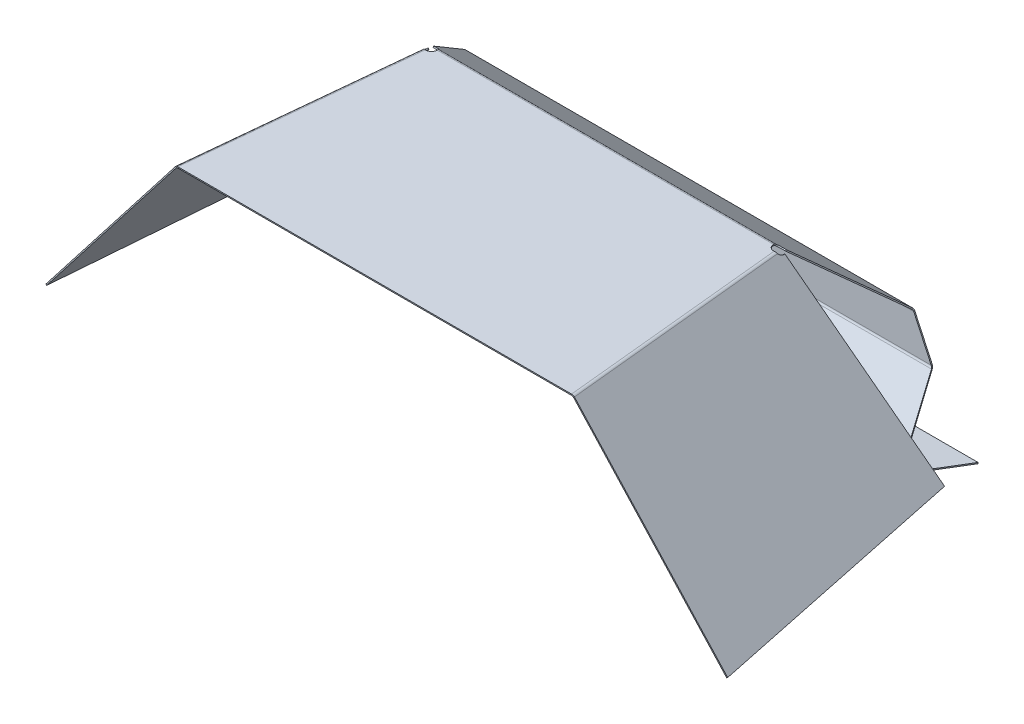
ISO-10303-21;
HEADER;
FILE_DESCRIPTION(('STEP AP214'),'2;1');
FILE_NAME('part.step','',(''),(''),'','','');
FILE_SCHEMA(('AUTOMOTIVE_DESIGN { 1 0 10303 214 1 1 1 1 }'));
ENDSEC;
DATA;
#1=APPLICATION_CONTEXT('core data for automotive mechanical design processes');
#2=APPLICATION_PROTOCOL_DEFINITION('international standard','automotive_design',2000,#1);
#3=PRODUCT_CONTEXT('',#1,'mechanical');
#4=PRODUCT('Part','Part','',(#3));
#5=PRODUCT_RELATED_PRODUCT_CATEGORY('part','',(#4));
#6=PRODUCT_DEFINITION_FORMATION('','',#4);
#7=PRODUCT_DEFINITION_CONTEXT('part definition',#1,'design');
#8=PRODUCT_DEFINITION('design','',#6,#7);
#9=PRODUCT_DEFINITION_SHAPE('','',#8);
#10=(LENGTH_UNIT() NAMED_UNIT(*) SI_UNIT(.MILLI.,.METRE.));
#11=(NAMED_UNIT(*) PLANE_ANGLE_UNIT() SI_UNIT($,.RADIAN.));
#12=(NAMED_UNIT(*) SI_UNIT($,.STERADIAN.) SOLID_ANGLE_UNIT());
#13=UNCERTAINTY_MEASURE_WITH_UNIT(LENGTH_MEASURE(1.E-05),#10,'distance_accuracy_value','');
#14=(GEOMETRIC_REPRESENTATION_CONTEXT(3) GLOBAL_UNCERTAINTY_ASSIGNED_CONTEXT((#13)) GLOBAL_UNIT_ASSIGNED_CONTEXT((#10,
#11,#12)) REPRESENTATION_CONTEXT('',''));
#15=CARTESIAN_POINT('',(0.,0.,0.));
#16=DIRECTION('',(0.,0.,1.));
#17=DIRECTION('',(1.,0.,0.));
#18=AXIS2_PLACEMENT_3D('',#15,#16,#17);
#19=CARTESIAN_POINT('',(-260.235,375.136031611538,-46.2043893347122));
#20=DIRECTION('',(0.,0.258819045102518,-0.965925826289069));
#21=DIRECTION('',(0.,0.965925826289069,0.258819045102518));
#22=AXIS2_PLACEMENT_3D('',#19,#20,#21);
#23=PLANE('',#22);
#24=DIRECTION('',(-0.420236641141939,-0.876495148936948,-0.234856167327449));
#25=VECTOR('',#24,1.);
#26=CARTESIAN_POINT('',(-229.83,80.646856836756,-125.112525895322));
#27=LINE('',#26,#25);
#28=CARTESIAN_POINT('',(-357.985863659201,-186.65014158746,-196.734540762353));
#29=VERTEX_POINT('',#28);
#30=CARTESIAN_POINT('',(-368.104478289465,-207.754718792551,-202.389495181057));
#31=VERTEX_POINT('',#30);
#32=EDGE_CURVE('E167',#29,#31,#27,.T.);
#33=ORIENTED_EDGE('',*,*,#32,.T.);
#34=DIRECTION('',(1.,0.,0.));
#35=VECTOR('',#34,1.);
#36=CARTESIAN_POINT('',(-260.235,-207.754718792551,-202.389495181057));
#37=LINE('',#36,#35);
#38=CARTESIAN_POINT('',(368.104478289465,-207.754718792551,-202.389495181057));
#39=VERTEX_POINT('',#38);
#40=EDGE_CURVE('E160',#31,#39,#37,.T.);
#41=ORIENTED_EDGE('',*,*,#40,.T.);
#42=DIRECTION('',(-0.42023664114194,0.876495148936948,0.234856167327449));
#43=VECTOR('',#42,1.);
#44=CARTESIAN_POINT('',(391.92,-257.427182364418,-215.699191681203));
#45=LINE('',#44,#43);
#46=CARTESIAN_POINT('',(357.985863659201,-186.65014158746,-196.734540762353));
#47=VERTEX_POINT('',#46);
#48=EDGE_CURVE('E175',#39,#47,#45,.T.);
#49=ORIENTED_EDGE('',*,*,#48,.T.);
#50=DIRECTION('',(-1.,0.,0.));
#51=VECTOR('',#50,1.);
#52=CARTESIAN_POINT('',(-260.235,-186.65014158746,-196.734540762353));
#53=LINE('',#52,#51);
#54=EDGE_CURVE('E578',#47,#29,#53,.T.);
#55=ORIENTED_EDGE('',*,*,#54,.T.);
#56=EDGE_LOOP('',(#33,#41,#49,#55));
#57=FACE_BOUND('',#56,.T.);
#58=ADVANCED_FACE('F148',(#57),#23,.F.);
#59=CARTESIAN_POINT('',(-229.83,-46.9786411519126,-434.982047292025));
#60=DIRECTION('',(-0.907414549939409,0.210118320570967,-0.363935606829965));
#61=DIRECTION('',(0.420236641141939,0.453707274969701,-0.785844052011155));
#62=AXIS2_PLACEMENT_3D('',#59,#60,#61);
#63=PLANE('',#62);
#64=DIRECTION('',(-0.420236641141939,-0.453707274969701,0.785844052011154));
#65=VECTOR('',#64,1.);
#66=CARTESIAN_POINT('',(-229.83,-46.9786411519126,-434.982047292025));
#67=LINE('',#66,#65);
#68=CARTESIAN_POINT('',(-322.368328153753,-146.887379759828,-261.93503610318));
#69=VERTEX_POINT('',#68);
#70=CARTESIAN_POINT('',(-355.712556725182,-182.88737972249,-199.581207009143));
#71=VERTEX_POINT('',#70);
#72=EDGE_CURVE('E716',#69,#71,#67,.T.);
#73=ORIENTED_EDGE('',*,*,#72,.T.);
#74=CARTESIAN_POINT('',(-355.712556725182,-181.588341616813,-198.831207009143));
#75=CARTESIAN_POINT('',(-355.712556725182,-182.88737972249,-199.581207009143));
#76=B_SPLINE_CURVE_WITH_KNOTS('',1,(#74,#75),.UNSPECIFIED.,.F.,.F.,(2,2),(0.,1.),.UNSPECIFIED.);
#77=CARTESIAN_POINT('',(-355.712556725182,-181.588341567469,-198.831206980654));
#78=VERTEX_POINT('',#77);
#79=EDGE_CURVE('E1914',#71,#78,#76,.F.);
#80=ORIENTED_EDGE('',*,*,#79,.T.);
#81=DIRECTION('',(-0.420236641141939,-0.453707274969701,0.785844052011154));
#82=VECTOR('',#81,1.);
#83=CARTESIAN_POINT('',(-229.83,-45.679603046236,-434.232047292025));
#84=LINE('',#83,#82);
#85=CARTESIAN_POINT('',(-322.368328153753,-145.588341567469,-261.185036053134));
#86=VERTEX_POINT('',#85);
#87=EDGE_CURVE('E710',#86,#78,#84,.T.);
#88=ORIENTED_EDGE('',*,*,#87,.F.);
#89=CARTESIAN_POINT('',(-322.368328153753,-146.887379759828,-261.93503610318));
#90=CARTESIAN_POINT('',(-322.368328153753,-145.588341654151,-261.18503610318));
#91=B_SPLINE_CURVE_WITH_KNOTS('',1,(#89,#90),.UNSPECIFIED.,.F.,.F.,(2,2),(0.,1.),.UNSPECIFIED.);
#92=EDGE_CURVE('E714',#69,#86,#91,.T.);
#93=ORIENTED_EDGE('',*,*,#92,.F.);
#94=EDGE_LOOP('',(#73,#80,#88,#93));
#95=FACE_BOUND('',#94,.T.);
#96=ADVANCED_FACE('F638',(#95),#63,.T.);
#97=CARTESIAN_POINT('',(391.92,-221.978641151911,-131.873155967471));
#98=DIRECTION('',(0.907414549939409,0.210118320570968,-0.363935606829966));
#99=DIRECTION('',(0.42023664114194,-0.4537072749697,0.785844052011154));
#100=AXIS2_PLACEMENT_3D('',#97,#98,#99);
#101=PLANE('',#100);
#102=DIRECTION('',(-0.42023664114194,0.4537072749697,-0.785844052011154));
#103=VECTOR('',#102,1.);
#104=CARTESIAN_POINT('',(391.92,-220.679603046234,-131.123155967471));
#105=LINE('',#104,#103);
#106=CARTESIAN_POINT('',(355.712556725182,-181.588341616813,-198.831207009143));
#107=VERTEX_POINT('',#106);
#108=CARTESIAN_POINT('',(322.368328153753,-145.588341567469,-261.185036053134));
#109=VERTEX_POINT('',#108);
#110=EDGE_CURVE('E711',#107,#109,#105,.T.);
#111=ORIENTED_EDGE('',*,*,#110,.F.);
#112=CARTESIAN_POINT('',(355.712556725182,-182.88737972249,-199.581207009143));
#113=CARTESIAN_POINT('',(355.712556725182,-181.588341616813,-198.831207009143));
#114=B_SPLINE_CURVE_WITH_KNOTS('',1,(#112,#113),.UNSPECIFIED.,.F.,.F.,(2,2),(0.,1.),.UNSPECIFIED.);
#115=CARTESIAN_POINT('',(355.712556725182,-182.88737972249,-199.581207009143));
#116=VERTEX_POINT('',#115);
#117=EDGE_CURVE('E675',#107,#116,#114,.F.);
#118=ORIENTED_EDGE('',*,*,#117,.T.);
#119=DIRECTION('',(-0.42023664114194,0.4537072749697,-0.785844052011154));
#120=VECTOR('',#119,1.);
#121=CARTESIAN_POINT('',(391.92,-221.978641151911,-131.873155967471));
#122=LINE('',#121,#120);
#123=CARTESIAN_POINT('',(322.368328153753,-146.887379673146,-261.935036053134));
#124=VERTEX_POINT('',#123);
#125=EDGE_CURVE('E1928',#116,#124,#122,.T.);
#126=ORIENTED_EDGE('',*,*,#125,.T.);
#127=CARTESIAN_POINT('',(322.368328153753,-145.588341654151,-261.18503610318));
#128=CARTESIAN_POINT('',(322.368328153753,-146.887379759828,-261.93503610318));
#129=B_SPLINE_CURVE_WITH_KNOTS('',1,(#127,#128),.UNSPECIFIED.,.F.,.F.,(2,2),(0.,1.),.UNSPECIFIED.);
#130=EDGE_CURVE('E723',#109,#124,#129,.T.);
#131=ORIENTED_EDGE('',*,*,#130,.F.);
#132=EDGE_LOOP('',(#111,#118,#126,#131));
#133=FACE_BOUND('',#132,.T.);
#134=ADVANCED_FACE('F642',(#133),#101,.T.);
#135=CARTESIAN_POINT('',(-260.235,105.460172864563,-699.013818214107));
#136=DIRECTION('',(0.,-0.866025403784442,-0.499999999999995));
#137=DIRECTION('',(0.,0.499999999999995,-0.866025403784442));
#138=AXIS2_PLACEMENT_3D('',#135,#136,#137);
#139=PLANE('',#138);
#140=ORIENTED_EDGE('',*,*,#125,.F.);
#141=DIRECTION('',(-1.,0.,0.));
#142=VECTOR('',#141,1.);
#143=CARTESIAN_POINT('',(-260.235,-182.887379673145,-199.581206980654));
#144=LINE('',#143,#142);
#145=EDGE_CURVE('E667',#116,#71,#144,.T.);
#146=ORIENTED_EDGE('',*,*,#145,.T.);
#147=ORIENTED_EDGE('',*,*,#72,.F.);
#148=DIRECTION('',(-1.,0.,0.));
#149=VECTOR('',#148,1.);
#150=CARTESIAN_POINT('',(-260.235,-146.887379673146,-261.935036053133));
#151=LINE('',#150,#149);
#152=EDGE_CURVE('E724',#124,#69,#151,.T.);
#153=ORIENTED_EDGE('',*,*,#152,.F.);
#154=EDGE_LOOP('',(#140,#146,#147,#153));
#155=FACE_BOUND('',#154,.T.);
#156=ADVANCED_FACE('F647',(#155),#139,.T.);
#157=CARTESIAN_POINT('',(-229.83,52.9002208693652,-264.185036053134));
#158=DIRECTION('',(-0.907414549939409,0.420236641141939,0.));
#159=DIRECTION('',(0.420236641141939,0.90741454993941,0.));
#160=AXIS2_PLACEMENT_3D('',#157,#158,#159);
#161=PLANE('',#160);
#162=DIRECTION('',(-0.420236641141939,-0.90741454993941,0.));
#163=VECTOR('',#162,1.);
#164=CARTESIAN_POINT('',(-229.83,52.9002208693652,-264.185036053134));
#165=LINE('',#164,#163);
#166=CARTESIAN_POINT('',(-297.393968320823,-92.9902653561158,-264.185036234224));
#167=VERTEX_POINT('',#166);
#168=CARTESIAN_POINT('',(-320.549682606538,-142.990265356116,-264.185036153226));
#169=VERTEX_POINT('',#168);
#170=EDGE_CURVE('E1815',#167,#169,#165,.T.);
#171=ORIENTED_EDGE('',*,*,#170,.T.);
#172=CARTESIAN_POINT('',(-320.549682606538,-142.990265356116,-262.685036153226));
#173=CARTESIAN_POINT('',(-320.549682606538,-142.990265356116,-264.185036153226));
#174=B_SPLINE_CURVE_WITH_KNOTS('',1,(#172,#173),.UNSPECIFIED.,.F.,.F.,(2,2),(0.,1.),.UNSPECIFIED.);
#175=CARTESIAN_POINT('',(-320.549682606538,-142.990265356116,-262.685036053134));
#176=VERTEX_POINT('',#175);
#177=EDGE_CURVE('E676',#169,#176,#174,.F.);
#178=ORIENTED_EDGE('',*,*,#177,.T.);
#179=DIRECTION('',(-0.420236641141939,-0.90741454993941,0.));
#180=VECTOR('',#179,1.);
#181=CARTESIAN_POINT('',(-229.83,52.9002208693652,-262.685036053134));
#182=LINE('',#181,#180);
#183=CARTESIAN_POINT('',(-297.393968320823,-92.9902653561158,-262.685036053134));
#184=VERTEX_POINT('',#183);
#185=EDGE_CURVE('E1812',#184,#176,#182,.T.);
#186=ORIENTED_EDGE('',*,*,#185,.F.);
#187=CARTESIAN_POINT('',(-297.393968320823,-92.9902653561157,-264.185036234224));
#188=CARTESIAN_POINT('',(-297.393968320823,-92.9902653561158,-262.685036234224));
#189=B_SPLINE_CURVE_WITH_KNOTS('',1,(#187,#188),.UNSPECIFIED.,.F.,.F.,(2,2),(0.,1.),.UNSPECIFIED.);
#190=EDGE_CURVE('E1817',#167,#184,#189,.T.);
#191=ORIENTED_EDGE('',*,*,#190,.F.);
#192=EDGE_LOOP('',(#171,#178,#186,#191));
#193=FACE_BOUND('',#192,.T.);
#194=ADVANCED_FACE('F1746',(#193),#161,.T.);
#195=CARTESIAN_POINT('',(391.92,-297.099779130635,-264.185036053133));
#196=DIRECTION('',(0.907414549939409,0.42023664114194,0.));
#197=DIRECTION('',(0.42023664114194,-0.90741454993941,0.));
#198=AXIS2_PLACEMENT_3D('',#195,#196,#197);
#199=PLANE('',#198);
#200=DIRECTION('',(-0.42023664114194,0.907414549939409,0.));
#201=VECTOR('',#200,1.);
#202=CARTESIAN_POINT('',(391.92,-297.099779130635,-262.685036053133));
#203=LINE('',#202,#201);
#204=CARTESIAN_POINT('',(320.549682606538,-142.990265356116,-262.685036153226));
#205=VERTEX_POINT('',#204);
#206=CARTESIAN_POINT('',(297.393968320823,-92.9902653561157,-262.685036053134));
#207=VERTEX_POINT('',#206);
#208=EDGE_CURVE('E1798',#205,#207,#203,.T.);
#209=ORIENTED_EDGE('',*,*,#208,.F.);
#210=CARTESIAN_POINT('',(320.549682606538,-142.990265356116,-264.185036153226));
#211=CARTESIAN_POINT('',(320.549682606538,-142.990265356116,-262.685036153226));
#212=B_SPLINE_CURVE_WITH_KNOTS('',1,(#210,#211),.UNSPECIFIED.,.F.,.F.,(2,2),(0.,1.),.UNSPECIFIED.);
#213=CARTESIAN_POINT('',(320.549682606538,-142.990265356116,-264.185036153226));
#214=VERTEX_POINT('',#213);
#215=EDGE_CURVE('E815',#205,#214,#212,.F.);
#216=ORIENTED_EDGE('',*,*,#215,.T.);
#217=DIRECTION('',(-0.42023664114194,0.907414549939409,0.));
#218=VECTOR('',#217,1.);
#219=CARTESIAN_POINT('',(391.92,-297.099779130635,-264.185036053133));
#220=LINE('',#219,#218);
#221=CARTESIAN_POINT('',(297.393968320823,-92.9902653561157,-264.185036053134));
#222=VERTEX_POINT('',#221);
#223=EDGE_CURVE('E1790',#214,#222,#220,.T.);
#224=ORIENTED_EDGE('',*,*,#223,.T.);
#225=CARTESIAN_POINT('',(297.393968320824,-92.9902653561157,-262.685036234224));
#226=CARTESIAN_POINT('',(297.393968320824,-92.9902653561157,-264.185036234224));
#227=B_SPLINE_CURVE_WITH_KNOTS('',1,(#225,#226),.UNSPECIFIED.,.F.,.F.,(2,2),(0.,1.),.UNSPECIFIED.);
#228=EDGE_CURVE('E1799',#207,#222,#227,.T.);
#229=ORIENTED_EDGE('',*,*,#228,.F.);
#230=EDGE_LOOP('',(#209,#216,#224,#229));
#231=FACE_BOUND('',#230,.T.);
#232=ADVANCED_FACE('F1741',(#231),#199,.T.);
#233=CARTESIAN_POINT('',(-260.235,357.777848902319,-264.185036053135));
#234=DIRECTION('',(0.,0.,-1.));
#235=DIRECTION('',(0.,1.,0.));
#236=AXIS2_PLACEMENT_3D('',#233,#234,#235);
#237=PLANE('',#236);
#238=ORIENTED_EDGE('',*,*,#223,.F.);
#239=DIRECTION('',(-1.,0.,0.));
#240=VECTOR('',#239,1.);
#241=CARTESIAN_POINT('',(-260.235,-142.990265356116,-264.185036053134));
#242=LINE('',#241,#240);
#243=EDGE_CURVE('E1769',#214,#169,#242,.T.);
#244=ORIENTED_EDGE('',*,*,#243,.T.);
#245=ORIENTED_EDGE('',*,*,#170,.F.);
#246=DIRECTION('',(-1.,0.,0.));
#247=VECTOR('',#246,1.);
#248=CARTESIAN_POINT('',(-260.235,-92.9902653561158,-264.185036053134));
#249=LINE('',#248,#247);
#250=EDGE_CURVE('E750',#222,#167,#249,.T.);
#251=ORIENTED_EDGE('',*,*,#250,.F.);
#252=EDGE_LOOP('',(#238,#244,#245,#251));
#253=FACE_BOUND('',#252,.T.);
#254=ADVANCED_FACE('F1738',(#253),#237,.T.);
#255=CARTESIAN_POINT('',(-260.235,198.101575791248,80.2239541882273));
#256=DIRECTION('',(0.,0.766044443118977,-0.642787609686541));
#257=DIRECTION('',(0.,0.642787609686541,0.766044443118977));
#258=AXIS2_PLACEMENT_3D('',#255,#256,#257);
#259=PLANE('',#258);
#260=DIRECTION('',(-0.42023664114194,0.583274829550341,0.695119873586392));
#261=VECTOR('',#260,1.);
#262=CARTESIAN_POINT('',(391.92,-222.845649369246,-421.441413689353));
#263=LINE('',#262,#261);
#264=CARTESIAN_POINT('',(295.878430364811,-89.5430652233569,-262.577580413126));
#265=VERTEX_POINT('',#264);
#266=CARTESIAN_POINT('',(232.981774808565,-2.24454720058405,-158.539257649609));
#267=VERTEX_POINT('',#266);
#268=EDGE_CURVE('E983',#265,#267,#263,.T.);
#269=ORIENTED_EDGE('',*,*,#268,.F.);
#270=DIRECTION('',(-1.,0.,0.));
#271=VECTOR('',#270,1.);
#272=CARTESIAN_POINT('',(-260.235,-89.5430653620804,-262.577580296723));
#273=LINE('',#272,#271);
#274=CARTESIAN_POINT('',(-295.87843036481,-89.543065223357,-262.577580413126));
#275=VERTEX_POINT('',#274);
#276=EDGE_CURVE('E1691',#265,#275,#273,.T.);
#277=ORIENTED_EDGE('',*,*,#276,.T.);
#278=DIRECTION('',(-0.420236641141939,-0.583274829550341,-0.695119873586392));
#279=VECTOR('',#278,1.);
#280=CARTESIAN_POINT('',(-229.83,2.13001402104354,-153.325858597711));
#281=LINE('',#280,#279);
#282=CARTESIAN_POINT('',(-232.981774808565,-2.24454720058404,-158.539257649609));
#283=VERTEX_POINT('',#282);
#284=EDGE_CURVE('E1708',#283,#275,#281,.T.);
#285=ORIENTED_EDGE('',*,*,#284,.F.);
#286=CARTESIAN_POINT('',(-229.83,2.13001402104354,-153.325858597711));
#287=DIRECTION('',(0.,-0.766044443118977,0.642787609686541));
#288=DIRECTION('',(0.,-0.642787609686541,-0.766044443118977));
#289=AXIS2_PLACEMENT_3D('',#286,#287,#288);
#290=CIRCLE('',#289,7.50000000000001);
#291=CARTESIAN_POINT('',(-222.801763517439,0.447200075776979,-155.331358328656));
#292=VERTEX_POINT('',#291);
#293=EDGE_CURVE('E973',#283,#292,#290,.T.);
#294=ORIENTED_EDGE('',*,*,#293,.T.);
#295=DIRECTION('',(-1.,0.,0.));
#296=VECTOR('',#295,1.);
#297=CARTESIAN_POINT('',(-260.235,0.447199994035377,-155.331358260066));
#298=LINE('',#297,#296);
#299=CARTESIAN_POINT('',(222.801763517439,0.447199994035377,-155.331358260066));
#300=VERTEX_POINT('',#299);
#301=EDGE_CURVE('E1482',#300,#292,#298,.T.);
#302=ORIENTED_EDGE('',*,*,#301,.F.);
#303=CARTESIAN_POINT('',(229.83,2.13001402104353,-153.325858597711));
#304=DIRECTION('',(0.,-0.766044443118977,0.642787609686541));
#305=DIRECTION('',(0.,-0.642787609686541,-0.766044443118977));
#306=AXIS2_PLACEMENT_3D('',#303,#304,#305);
#307=CIRCLE('',#306,7.50000000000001);
#308=EDGE_CURVE('E978',#300,#267,#307,.T.);
#309=ORIENTED_EDGE('',*,*,#308,.T.);
#310=EDGE_LOOP('',(#269,#277,#285,#294,#302,#309));
#311=FACE_BOUND('',#310,.T.);
#312=ADVANCED_FACE('F1457',(#311),#259,.T.);
#313=CARTESIAN_POINT('',(391.92,-222.845649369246,-421.441413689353));
#314=DIRECTION('',(0.907414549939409,0.270122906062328,0.321919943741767));
#315=DIRECTION('',(0.42023664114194,-0.583274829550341,-0.695119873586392));
#316=AXIS2_PLACEMENT_3D('',#313,#314,#315);
#317=PLANE('',#316);
#318=DIRECTION('',(-0.42023664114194,0.583274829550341,0.695119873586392));
#319=VECTOR('',#318,1.);
#320=CARTESIAN_POINT('',(391.92,-223.994716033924,-420.477232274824));
#321=LINE('',#320,#319);
#322=CARTESIAN_POINT('',(295.878430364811,-90.6921318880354,-261.613398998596));
#323=VERTEX_POINT('',#322);
#324=CARTESIAN_POINT('',(232.981774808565,-3.3936138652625,-157.57507623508));
#325=VERTEX_POINT('',#324);
#326=EDGE_CURVE('E965',#323,#325,#321,.T.);
#327=ORIENTED_EDGE('',*,*,#326,.F.);
#328=CARTESIAN_POINT('',(295.878430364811,-89.5430652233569,-262.577580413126));
#329=CARTESIAN_POINT('',(295.878430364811,-90.6921318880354,-261.613398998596));
#330=B_SPLINE_CURVE_WITH_KNOTS('',1,(#328,#329),.UNSPECIFIED.,.F.,.F.,(2,2),(0.,1.),.UNSPECIFIED.);
#331=EDGE_CURVE('E935',#323,#265,#330,.F.);
#332=ORIENTED_EDGE('',*,*,#331,.T.);
#333=ORIENTED_EDGE('',*,*,#268,.T.);
#334=DIRECTION('',(0.,-0.766044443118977,0.642787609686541));
#335=VECTOR('',#334,1.);
#336=CARTESIAN_POINT('',(232.981774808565,-3.3936138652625,-157.57507623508));
#337=LINE('',#336,#335);
#338=EDGE_CURVE('E966',#325,#267,#337,.F.);
#339=ORIENTED_EDGE('',*,*,#338,.F.);
#340=EDGE_LOOP('',(#327,#332,#333,#339));
#341=FACE_BOUND('',#340,.T.);
#342=ADVANCED_FACE('F1722',(#341),#317,.T.);
#343=CARTESIAN_POINT('',(-229.83,2.13001402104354,-153.325858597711));
#344=DIRECTION('',(-0.907414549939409,0.270122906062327,0.321919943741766));
#345=DIRECTION('',(0.420236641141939,0.583274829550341,0.695119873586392));
#346=AXIS2_PLACEMENT_3D('',#343,#344,#345);
#347=PLANE('',#346);
#348=ORIENTED_EDGE('',*,*,#284,.T.);
#349=CARTESIAN_POINT('',(-295.87843036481,-90.6921318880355,-261.613398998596));
#350=CARTESIAN_POINT('',(-295.87843036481,-89.543065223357,-262.577580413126));
#351=B_SPLINE_CURVE_WITH_KNOTS('',1,(#349,#350),.UNSPECIFIED.,.F.,.F.,(2,2),(0.,1.),.UNSPECIFIED.);
#352=CARTESIAN_POINT('',(-295.87843036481,-90.6921320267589,-261.613398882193));
#353=VERTEX_POINT('',#352);
#354=EDGE_CURVE('E949',#275,#353,#351,.F.);
#355=ORIENTED_EDGE('',*,*,#354,.T.);
#356=DIRECTION('',(-0.420236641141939,-0.583274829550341,-0.695119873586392));
#357=VECTOR('',#356,1.);
#358=CARTESIAN_POINT('',(-229.83,0.980947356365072,-152.361677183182));
#359=LINE('',#358,#357);
#360=CARTESIAN_POINT('',(-232.981774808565,-3.3936138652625,-157.575076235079));
#361=VERTEX_POINT('',#360);
#362=EDGE_CURVE('E2374',#361,#353,#359,.T.);
#363=ORIENTED_EDGE('',*,*,#362,.F.);
#364=DIRECTION('',(0.,0.766044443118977,-0.642787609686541));
#365=VECTOR('',#364,1.);
#366=CARTESIAN_POINT('',(-232.981774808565,-2.24454720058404,-158.539257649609));
#367=LINE('',#366,#365);
#368=EDGE_CURVE('E961',#283,#361,#367,.F.);
#369=ORIENTED_EDGE('',*,*,#368,.F.);
#370=EDGE_LOOP('',(#348,#355,#363,#369));
#371=FACE_BOUND('',#370,.T.);
#372=ADVANCED_FACE('F1492',(#371),#347,.T.);
#373=CARTESIAN_POINT('',(229.83,0.,-152.438814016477));
#374=DIRECTION('',(0.,-1.,0.));
#375=DIRECTION('',(0.,0.,-1.));
#376=AXIS2_PLACEMENT_3D('',#373,#374,#375);
#377=CYLINDRICAL_SURFACE('',#376,7.50000000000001);
#378=CARTESIAN_POINT('',(229.83,0.,-152.438814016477));
#379=DIRECTION('',(0.,-1.,0.));
#380=DIRECTION('',(0.,0.,-1.));
#381=AXIS2_PLACEMENT_3D('',#378,#379,#380);
#382=CIRCLE('',#381,7.50000000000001);
#383=CARTESIAN_POINT('',(230.574272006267,0.,-144.975834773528));
#384=VERTEX_POINT('',#383);
#385=CARTESIAN_POINT('',(222.33,1.06706109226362E-07,-152.438814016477));
#386=VERTEX_POINT('',#385);
#387=EDGE_CURVE('E1511',#384,#386,#382,.T.);
#388=ORIENTED_EDGE('',*,*,#387,.T.);
#389=CARTESIAN_POINT('',(222.33,1.50000010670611,-152.438814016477));
#390=CARTESIAN_POINT('',(222.33,1.06706109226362E-07,-152.438814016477));
#391=B_SPLINE_CURVE_WITH_KNOTS('',1,(#389,#390),.UNSPECIFIED.,.F.,.F.,(2,2),(0.,1.),.UNSPECIFIED.);
#392=CARTESIAN_POINT('',(222.33,1.50000010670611,-152.438814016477));
#393=VERTEX_POINT('',#392);
#394=EDGE_CURVE('E1089',#386,#393,#391,.F.);
#395=ORIENTED_EDGE('',*,*,#394,.T.);
#396=CARTESIAN_POINT('',(229.83,1.5,-152.438814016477));
#397=DIRECTION('',(0.,-1.,0.));
#398=DIRECTION('',(0.,0.,-1.));
#399=AXIS2_PLACEMENT_3D('',#396,#397,#398);
#400=CIRCLE('',#399,7.50000000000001);
#401=CARTESIAN_POINT('',(230.574272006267,1.5000001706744,-144.975834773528));
#402=VERTEX_POINT('',#401);
#403=EDGE_CURVE('E1414',#402,#393,#400,.T.);
#404=ORIENTED_EDGE('',*,*,#403,.F.);
#405=CARTESIAN_POINT('',(230.574272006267,1.70674401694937E-07,-144.975834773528));
#406=CARTESIAN_POINT('',(230.574272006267,1.5000001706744,-144.975834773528));
#407=B_SPLINE_CURVE_WITH_KNOTS('',1,(#405,#406),.UNSPECIFIED.,.F.,.F.,(2,2),(0.,1.),.UNSPECIFIED.);
#408=EDGE_CURVE('E1474',#384,#402,#407,.T.);
#409=ORIENTED_EDGE('',*,*,#408,.F.);
#410=EDGE_LOOP('',(#388,#395,#404,#409));
#411=FACE_BOUND('',#410,.T.);
#412=ADVANCED_FACE('F1484',(#411),#377,.F.);
#413=CARTESIAN_POINT('',(-260.235,1.5,152.438814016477));
#414=DIRECTION('',(0.,1.,0.));
#415=DIRECTION('',(0.,0.,1.));
#416=AXIS2_PLACEMENT_3D('',#413,#414,#415);
#417=PLANE('',#416);
#418=ORIENTED_EDGE('',*,*,#403,.T.);
#419=DIRECTION('',(-1.,0.,0.));
#420=VECTOR('',#419,1.);
#421=CARTESIAN_POINT('',(-260.235,1.5,-152.438814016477));
#422=LINE('',#421,#420);
#423=CARTESIAN_POINT('',(-222.33,1.50000010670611,-152.438814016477));
#424=VERTEX_POINT('',#423);
#425=EDGE_CURVE('E1466',#393,#424,#422,.T.);
#426=ORIENTED_EDGE('',*,*,#425,.T.);
#427=CARTESIAN_POINT('',(-229.83,1.5,-152.438814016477));
#428=DIRECTION('',(0.,-1.,0.));
#429=DIRECTION('',(0.,0.,-1.));
#430=AXIS2_PLACEMENT_3D('',#427,#428,#429);
#431=CIRCLE('',#430,7.50000000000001);
#432=CARTESIAN_POINT('',(-230.574272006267,1.5000001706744,-144.975834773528));
#433=VERTEX_POINT('',#432);
#434=EDGE_CURVE('E1525',#424,#433,#431,.T.);
#435=ORIENTED_EDGE('',*,*,#434,.T.);
#436=DIRECTION('',(-0.0992362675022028,0.,0.99506389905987));
#437=VECTOR('',#436,1.);
#438=CARTESIAN_POINT('',(-260.235,1.5,152.438814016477));
#439=LINE('',#438,#437);
#440=CARTESIAN_POINT('',(-260.235,1.5000001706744,152.438814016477));
#441=VERTEX_POINT('',#440);
#442=EDGE_CURVE('E1423',#433,#441,#439,.T.);
#443=ORIENTED_EDGE('',*,*,#442,.T.);
#444=DIRECTION('',(1.,0.,0.));
#445=VECTOR('',#444,1.);
#446=CARTESIAN_POINT('',(-260.235,1.5,152.438814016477));
#447=LINE('',#446,#445);
#448=CARTESIAN_POINT('',(260.235,1.5,152.438814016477));
#449=VERTEX_POINT('',#448);
#450=EDGE_CURVE('E1413',#441,#449,#447,.T.);
#451=ORIENTED_EDGE('',*,*,#450,.T.);
#452=DIRECTION('',(0.0992362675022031,0.,0.99506389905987));
#453=VECTOR('',#452,1.);
#454=CARTESIAN_POINT('',(255.10949638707,1.5,101.044261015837));
#455=LINE('',#454,#453);
#456=EDGE_CURVE('E1675',#402,#449,#455,.T.);
#457=ORIENTED_EDGE('',*,*,#456,.F.);
#458=EDGE_LOOP('',(#418,#426,#435,#443,#451,#457));
#459=FACE_BOUND('',#458,.T.);
#460=ADVANCED_FACE('F1455',(#459),#417,.T.);
#461=CARTESIAN_POINT('',(-229.83,1.5,-152.438814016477));
#462=DIRECTION('',(0.,-1.,0.));
#463=DIRECTION('',(0.,0.,-1.));
#464=AXIS2_PLACEMENT_3D('',#461,#462,#463);
#465=CYLINDRICAL_SURFACE('',#464,7.50000000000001);
#466=ORIENTED_EDGE('',*,*,#434,.F.);
#467=CARTESIAN_POINT('',(-222.33,1.06706109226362E-07,-152.438814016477));
#468=CARTESIAN_POINT('',(-222.33,1.50000010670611,-152.438814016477));
#469=B_SPLINE_CURVE_WITH_KNOTS('',1,(#467,#468),.UNSPECIFIED.,.F.,.F.,(2,2),(0.,1.),.UNSPECIFIED.);
#470=CARTESIAN_POINT('',(-222.33,0.,-152.438814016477));
#471=VERTEX_POINT('',#470);
#472=EDGE_CURVE('E1103',#424,#471,#469,.F.);
#473=ORIENTED_EDGE('',*,*,#472,.T.);
#474=CARTESIAN_POINT('',(-229.83,0.,-152.438814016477));
#475=DIRECTION('',(0.,-1.,0.));
#476=DIRECTION('',(0.,0.,-1.));
#477=AXIS2_PLACEMENT_3D('',#474,#475,#476);
#478=CIRCLE('',#477,7.50000000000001);
#479=CARTESIAN_POINT('',(-230.574272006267,1.70674400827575E-07,-144.975834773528));
#480=VERTEX_POINT('',#479);
#481=EDGE_CURVE('E1514',#471,#480,#478,.T.);
#482=ORIENTED_EDGE('',*,*,#481,.T.);
#483=CARTESIAN_POINT('',(-230.574272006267,1.5000001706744,-144.975834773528));
#484=CARTESIAN_POINT('',(-230.574272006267,1.70674400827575E-07,-144.975834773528));
#485=B_SPLINE_CURVE_WITH_KNOTS('',1,(#483,#484),.UNSPECIFIED.,.F.,.F.,(2,2),(0.,1.),.UNSPECIFIED.);
#486=EDGE_CURVE('E1384',#480,#433,#485,.F.);
#487=ORIENTED_EDGE('',*,*,#486,.T.);
#488=EDGE_LOOP('',(#466,#473,#482,#487));
#489=FACE_BOUND('',#488,.T.);
#490=ADVANCED_FACE('F1444',(#489),#465,.F.);
#491=CARTESIAN_POINT('',(-260.235,0.,152.438814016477));
#492=DIRECTION('',(0.,1.,0.));
#493=DIRECTION('',(0.,0.,1.));
#494=AXIS2_PLACEMENT_3D('',#491,#492,#493);
#495=PLANE('',#494);
#496=DIRECTION('',(-1.,0.,0.));
#497=VECTOR('',#496,1.);
#498=CARTESIAN_POINT('',(-260.235,0.,-152.438814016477));
#499=LINE('',#498,#497);
#500=EDGE_CURVE('E1689',#386,#471,#499,.T.);
#501=ORIENTED_EDGE('',*,*,#500,.F.);
#502=ORIENTED_EDGE('',*,*,#387,.F.);
#503=DIRECTION('',(0.0992362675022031,0.,0.99506389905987));
#504=VECTOR('',#503,1.);
#505=CARTESIAN_POINT('',(255.10949638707,0.,101.044261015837));
#506=LINE('',#505,#504);
#507=CARTESIAN_POINT('',(260.235,0.,152.438814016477));
#508=VERTEX_POINT('',#507);
#509=EDGE_CURVE('E1501',#384,#508,#506,.T.);
#510=ORIENTED_EDGE('',*,*,#509,.T.);
#511=DIRECTION('',(1.,0.,0.));
#512=VECTOR('',#511,1.);
#513=CARTESIAN_POINT('',(-260.235,0.,152.438814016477));
#514=LINE('',#513,#512);
#515=CARTESIAN_POINT('',(-260.235,0.,152.438814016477));
#516=VERTEX_POINT('',#515);
#517=EDGE_CURVE('E1411',#516,#508,#514,.T.);
#518=ORIENTED_EDGE('',*,*,#517,.F.);
#519=DIRECTION('',(-0.0992362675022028,0.,0.99506389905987));
#520=VECTOR('',#519,1.);
#521=CARTESIAN_POINT('',(-260.235,0.,152.438814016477));
#522=LINE('',#521,#520);
#523=EDGE_CURVE('E1402',#480,#516,#522,.T.);
#524=ORIENTED_EDGE('',*,*,#523,.F.);
#525=ORIENTED_EDGE('',*,*,#481,.F.);
#526=EDGE_LOOP('',(#501,#502,#510,#518,#524,#525));
#527=FACE_BOUND('',#526,.T.);
#528=ADVANCED_FACE('F1454',(#527),#495,.F.);
#529=CARTESIAN_POINT('',(-260.235,1.5,152.438814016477));
#530=DIRECTION('',(0.,0.,-1.));
#531=DIRECTION('',(-1.,0.,0.));
#532=AXIS2_PLACEMENT_3D('',#529,#530,#531);
#533=PLANE('',#532);
#534=ORIENTED_EDGE('',*,*,#517,.T.);
#535=CARTESIAN_POINT('',(260.235,1.5000001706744,152.438814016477));
#536=CARTESIAN_POINT('',(260.235,1.70674401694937E-07,152.438814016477));
#537=B_SPLINE_CURVE_WITH_KNOTS('',1,(#535,#536),.UNSPECIFIED.,.F.,.F.,(2,2),(0.,1.),.UNSPECIFIED.);
#538=EDGE_CURVE('E1242',#449,#508,#537,.T.);
#539=ORIENTED_EDGE('',*,*,#538,.F.);
#540=ORIENTED_EDGE('',*,*,#450,.F.);
#541=CARTESIAN_POINT('',(-260.235,1.70674400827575E-07,152.438814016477));
#542=CARTESIAN_POINT('',(-260.235,1.5000001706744,152.438814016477));
#543=B_SPLINE_CURVE_WITH_KNOTS('',1,(#541,#542),.UNSPECIFIED.,.F.,.F.,(2,2),(0.,1.),.UNSPECIFIED.);
#544=EDGE_CURVE('E1398',#441,#516,#543,.F.);
#545=ORIENTED_EDGE('',*,*,#544,.T.);
#546=EDGE_LOOP('',(#534,#539,#540,#545));
#547=FACE_BOUND('',#546,.T.);
#548=ADVANCED_FACE('F1354',(#547),#533,.F.);
#549=CARTESIAN_POINT('',(-230.574272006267,1.5000001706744,-144.975834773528));
#550=CARTESIAN_POINT('',(-231.385798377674,1.5000001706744,-145.101722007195));
#551=CARTESIAN_POINT('',(-232.106006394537,1.27711901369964,-145.262752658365));
#552=CARTESIAN_POINT('',(-233.258889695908,0.634371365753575,-145.645752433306));
#553=CARTESIAN_POINT('',(-233.692988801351,0.215977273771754,-145.868430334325));
#554=CARTESIAN_POINT('',(-233.999225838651,-0.198684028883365,-146.121473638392));
#555=CARTESIAN_POINT('',(-230.574272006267,1.70674400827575E-07,-144.975834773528));
#556=CARTESIAN_POINT('',(-231.113801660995,1.70674400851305E-07,-145.074595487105));
#557=CARTESIAN_POINT('',(-231.591012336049,-0.148587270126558,-145.211393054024));
#558=CARTESIAN_POINT('',(-232.350779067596,-0.57708571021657,-145.555187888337));
#559=CARTESIAN_POINT('',(-232.634169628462,-0.855868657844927,-145.762717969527));
#560=CARTESIAN_POINT('',(-232.831108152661,-1.13245598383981,-146.004978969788));
#561=B_SPLINE_SURFACE_WITH_KNOTS('',1,3,((#549,#550,#551,#552,#553,#554),(#555,#556,#557,#558,
#559,#560)),.UNSPECIFIED.,.F.,.F.,.F.,(2,2),(4,2,4),(0.,1.),(0.,0.5,1.),.UNSPECIFIED.);
#562=CARTESIAN_POINT('',(-230.574272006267,1.70674400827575E-07,-144.975834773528));
#563=CARTESIAN_POINT('',(-231.113801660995,1.70674400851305E-07,-145.074595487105));
#564=CARTESIAN_POINT('',(-231.591012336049,-0.148587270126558,-145.211393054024));
#565=CARTESIAN_POINT('',(-232.350779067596,-0.57708571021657,-145.555187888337));
#566=CARTESIAN_POINT('',(-232.634169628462,-0.855868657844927,-145.762717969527));
#567=CARTESIAN_POINT('',(-232.831108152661,-1.13245598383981,-146.004978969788));
#568=B_SPLINE_CURVE_WITH_KNOTS('',3,(#562,#563,#564,#565,#566,#567),.UNSPECIFIED.,.F.,.F.,(4,2,
4),(0.,0.5,1.),.UNSPECIFIED.);
#569=CARTESIAN_POINT('',(-232.831108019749,-1.13245609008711,-146.004978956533));
#570=VERTEX_POINT('',#569);
#571=EDGE_CURVE('E1254',#480,#570,#568,.T.);
#572=CARTESIAN_POINT('',(-232.831108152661,-1.13245598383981,-146.004978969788));
#573=CARTESIAN_POINT('',(-233.999225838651,-0.198684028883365,-146.121473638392));
#574=B_SPLINE_CURVE_WITH_KNOTS('',1,(#572,#573),.UNSPECIFIED.,.F.,.F.,(2,2),(0.,1.),.UNSPECIFIED.);
#575=CARTESIAN_POINT('',(-233.999225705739,-0.198684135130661,-146.121473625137));
#576=VERTEX_POINT('',#575);
#577=EDGE_CURVE('E1275',#570,#576,#574,.T.);
#578=CARTESIAN_POINT('',(-233.999225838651,-0.198684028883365,-146.121473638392));
#579=CARTESIAN_POINT('',(-233.692988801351,0.215977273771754,-145.868430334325));
#580=CARTESIAN_POINT('',(-233.258889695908,0.634371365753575,-145.645752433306));
#581=CARTESIAN_POINT('',(-232.106006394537,1.27711901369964,-145.262752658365));
#582=CARTESIAN_POINT('',(-231.385798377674,1.5000001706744,-145.101722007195));
#583=CARTESIAN_POINT('',(-230.574272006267,1.5000001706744,-144.975834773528));
#584=B_SPLINE_CURVE_WITH_KNOTS('',3,(#578,#579,#580,#581,#582,#583),.UNSPECIFIED.,.F.,.F.,(4,2,
4),(0.,0.5,1.),.UNSPECIFIED.);
#585=EDGE_CURVE('E1319',#433,#576,#584,.F.);
#586=ORIENTED_EDGE('',*,*,#486,.F.);
#587=ORIENTED_EDGE('',*,*,#571,.T.);
#588=ORIENTED_EDGE('',*,*,#577,.T.);
#589=ORIENTED_EDGE('',*,*,#585,.F.);
#590=EDGE_LOOP('',(#586,#587,#588,#589));
#591=FACE_BOUND('',#590,.T.);
#592=ADVANCED_FACE('F1343',(#591),#561,.T.);
#593=CARTESIAN_POINT('',(-263.742530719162,-0.198684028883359,152.121191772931));
#594=CARTESIAN_POINT('',(-263.324285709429,0.329061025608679,152.157537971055));
#595=CARTESIAN_POINT('',(-262.78666564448,0.760268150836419,152.205792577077));
#596=CARTESIAN_POINT('',(-261.577219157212,1.34601631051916,152.315682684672));
#597=CARTESIAN_POINT('',(-260.90654250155,1.5000001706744,152.377206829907));
#598=CARTESIAN_POINT('',(-260.235,1.5000001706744,152.438814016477));
#599=CARTESIAN_POINT('',(-262.574413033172,-1.1324559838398,152.237686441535));
#600=CARTESIAN_POINT('',(-262.295406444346,-0.78062594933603,152.26014659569));
#601=CARTESIAN_POINT('',(-261.936816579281,-0.493154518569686,152.290546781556));
#602=CARTESIAN_POINT('',(-261.130165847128,-0.102655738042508,152.360266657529));
#603=CARTESIAN_POINT('',(-260.682871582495,1.70674401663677E-07,152.399513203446));
#604=CARTESIAN_POINT('',(-260.235,1.70674400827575E-07,152.438814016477));
#605=B_SPLINE_SURFACE_WITH_KNOTS('',1,3,((#593,#594,#595,#596,#597,#598),(#599,#600,#601,#602,
#603,#604)),.UNSPECIFIED.,.F.,.F.,.F.,(2,2),(4,2,4),(0.,1.),(0.,0.5,1.),.UNSPECIFIED.);
#606=CARTESIAN_POINT('',(-263.742530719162,-0.198684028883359,152.121191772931));
#607=CARTESIAN_POINT('',(-262.574413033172,-1.1324559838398,152.237686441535));
#608=B_SPLINE_CURVE_WITH_KNOTS('',1,(#606,#607),.UNSPECIFIED.,.F.,.F.,(2,2),(0.,1.),.UNSPECIFIED.);
#609=CARTESIAN_POINT('',(-263.742530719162,-0.19868402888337,152.12119177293));
#610=VERTEX_POINT('',#609);
#611=CARTESIAN_POINT('',(-262.57441290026,-1.13245609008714,152.23768645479));
#612=VERTEX_POINT('',#611);
#613=EDGE_CURVE('E1614',#610,#612,#608,.T.);
#614=CARTESIAN_POINT('',(-262.574413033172,-1.1324559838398,152.237686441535));
#615=CARTESIAN_POINT('',(-262.295406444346,-0.78062594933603,152.26014659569));
#616=CARTESIAN_POINT('',(-261.936816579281,-0.493154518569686,152.290546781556));
#617=CARTESIAN_POINT('',(-261.130165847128,-0.102655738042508,152.360266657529));
#618=CARTESIAN_POINT('',(-260.682871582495,1.70674401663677E-07,152.399513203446));
#619=CARTESIAN_POINT('',(-260.235,1.70674400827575E-07,152.438814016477));
#620=B_SPLINE_CURVE_WITH_KNOTS('',3,(#614,#615,#616,#617,#618,#619),.UNSPECIFIED.,.F.,.F.,(4,2,
4),(0.,0.5,1.),.UNSPECIFIED.);
#621=EDGE_CURVE('E2324',#612,#516,#620,.T.);
#622=CARTESIAN_POINT('',(-260.235,1.5000001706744,152.438814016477));
#623=CARTESIAN_POINT('',(-260.90654250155,1.5000001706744,152.377206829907));
#624=CARTESIAN_POINT('',(-261.577219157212,1.34601631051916,152.315682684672));
#625=CARTESIAN_POINT('',(-262.78666564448,0.760268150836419,152.205792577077));
#626=CARTESIAN_POINT('',(-263.324285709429,0.329061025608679,152.157537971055));
#627=CARTESIAN_POINT('',(-263.742530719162,-0.198684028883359,152.121191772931));
#628=B_SPLINE_CURVE_WITH_KNOTS('',3,(#622,#623,#624,#625,#626,#627),.UNSPECIFIED.,.F.,.F.,(4,2,
4),(0.,0.5,1.),.UNSPECIFIED.);
#629=EDGE_CURVE('E1527',#610,#441,#628,.F.);
#630=ORIENTED_EDGE('',*,*,#613,.T.);
#631=ORIENTED_EDGE('',*,*,#621,.T.);
#632=ORIENTED_EDGE('',*,*,#544,.F.);
#633=ORIENTED_EDGE('',*,*,#629,.F.);
#634=EDGE_LOOP('',(#630,#631,#632,#633));
#635=FACE_BOUND('',#634,.T.);
#636=ADVANCED_FACE('F1293',(#635),#605,.T.);
#637=CARTESIAN_POINT('',(-215.597105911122,-3.,-295.155176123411));
#638=DIRECTION('',(-0.0992362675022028,0.,0.99506389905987));
#639=DIRECTION('',(0.99506389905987,0.,0.0992362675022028));
#640=AXIS2_PLACEMENT_3D('',#637,#638,#639);
#641=CYLINDRICAL_SURFACE('',#640,4.5000001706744);
#642=ORIENTED_EDGE('',*,*,#629,.T.);
#643=ORIENTED_EDGE('',*,*,#442,.F.);
#644=ORIENTED_EDGE('',*,*,#585,.T.);
#645=DIRECTION('',(-0.0992362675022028,0.,0.99506389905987));
#646=VECTOR('',#645,1.);
#647=CARTESIAN_POINT('',(-263.739353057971,-0.198684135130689,152.089330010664));
#648=LINE('',#647,#646);
#649=EDGE_CURVE('E1611',#576,#610,#648,.T.);
#650=ORIENTED_EDGE('',*,*,#649,.T.);
#651=EDGE_LOOP('',(#642,#643,#644,#650));
#652=FACE_BOUND('',#651,.T.);
#653=ADVANCED_FACE('F1282',(#652),#641,.T.);
#654=CARTESIAN_POINT('',(-215.597105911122,-3.,-295.155176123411));
#655=DIRECTION('',(-0.0992362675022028,0.,0.99506389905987));
#656=DIRECTION('',(0.99506389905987,0.,0.0992362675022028));
#657=AXIS2_PLACEMENT_3D('',#654,#655,#656);
#658=CYLINDRICAL_SURFACE('',#657,3.0000001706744);
#659=ORIENTED_EDGE('',*,*,#621,.F.);
#660=DIRECTION('',(-0.0992362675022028,0.,0.99506389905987));
#661=VECTOR('',#660,1.);
#662=CARTESIAN_POINT('',(-262.571235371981,-1.13245609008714,152.205824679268));
#663=LINE('',#662,#661);
#664=EDGE_CURVE('E1633',#570,#612,#663,.T.);
#665=ORIENTED_EDGE('',*,*,#664,.F.);
#666=ORIENTED_EDGE('',*,*,#571,.F.);
#667=ORIENTED_EDGE('',*,*,#523,.T.);
#668=EDGE_LOOP('',(#659,#665,#666,#667));
#669=FACE_BOUND('',#668,.T.);
#670=ADVANCED_FACE('F1292',(#669),#658,.F.);
#671=CARTESIAN_POINT('',(-450.574804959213,-235.885507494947,136.363717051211));
#672=DIRECTION('',(-0.608553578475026,-0.779682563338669,-0.147504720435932));
#673=DIRECTION('',(-0.152376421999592,-0.0676064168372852,0.986007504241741));
#674=AXIS2_PLACEMENT_3D('',#671,#672,#673);
#675=PLANE('',#674);
#676=DIRECTION('',(0.152376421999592,0.0676064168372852,-0.98600750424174));
#677=VECTOR('',#676,1.);
#678=CARTESIAN_POINT('',(-449.406687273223,-236.819279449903,136.480211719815));
#679=LINE('',#678,#677);
#680=CARTESIAN_POINT('',(-449.406687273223,-236.819279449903,136.480211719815));
#681=VERTEX_POINT('',#680);
#682=CARTESIAN_POINT('',(-397.013578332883,-213.573489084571,-202.548608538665));
#683=VERTEX_POINT('',#682);
#684=EDGE_CURVE('E1259',#681,#683,#679,.T.);
#685=ORIENTED_EDGE('',*,*,#684,.F.);
#686=DIRECTION('',(0.778745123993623,-0.622514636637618,0.0776631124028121));
#687=VECTOR('',#686,1.);
#688=CARTESIAN_POINT('',(-450.574804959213,-235.885507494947,136.363717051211));
#689=LINE('',#688,#687);
#690=CARTESIAN_POINT('',(-450.574804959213,-235.885507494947,136.363717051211));
#691=VERTEX_POINT('',#690);
#692=EDGE_CURVE('E1246',#691,#681,#689,.T.);
#693=ORIENTED_EDGE('',*,*,#692,.F.);
#694=DIRECTION('',(0.152376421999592,0.0676064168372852,-0.98600750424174));
#695=VECTOR('',#694,1.);
#696=CARTESIAN_POINT('',(-450.574804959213,-235.885507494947,136.363717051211));
#697=LINE('',#696,#695);
#698=CARTESIAN_POINT('',(-398.181696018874,-212.639717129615,-202.665103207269));
#699=VERTEX_POINT('',#698);
#700=EDGE_CURVE('E1272',#691,#699,#697,.T.);
#701=ORIENTED_EDGE('',*,*,#700,.T.);
#702=DIRECTION('',(0.778745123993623,-0.622514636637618,0.0776631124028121));
#703=VECTOR('',#702,1.);
#704=CARTESIAN_POINT('',(-398.181696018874,-212.639717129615,-202.665103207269));
#705=LINE('',#704,#703);
#706=EDGE_CURVE('E1270',#699,#683,#705,.T.);
#707=ORIENTED_EDGE('',*,*,#706,.T.);
#708=EDGE_LOOP('',(#685,#693,#701,#707));
#709=FACE_BOUND('',#708,.T.);
#710=ADVANCED_FACE('F1216',(#709),#675,.T.);
#711=CARTESIAN_POINT('',(-398.181696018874,-212.639717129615,-202.665103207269));
#712=DIRECTION('',(0.172966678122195,0.0940604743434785,-0.980426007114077));
#713=DIRECTION('',(-0.603024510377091,-0.77693510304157,-0.180923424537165));
#714=AXIS2_PLACEMENT_3D('',#711,#712,#713);
#715=PLANE('',#714);
#716=DIRECTION('',(0.603024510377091,0.77693510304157,0.180923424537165));
#717=VECTOR('',#716,1.);
#718=CARTESIAN_POINT('',(-398.181696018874,-212.639717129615,-202.665103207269));
#719=LINE('',#718,#717);
#720=CARTESIAN_POINT('',(-235.769104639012,-3.38778582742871,-153.936997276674));
#721=VERTEX_POINT('',#720);
#722=EDGE_CURVE('E1267',#699,#721,#719,.T.);
#723=ORIENTED_EDGE('',*,*,#722,.T.);
#724=DIRECTION('',(-0.778745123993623,0.622514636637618,-0.0776631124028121));
#725=VECTOR('',#724,1.);
#726=CARTESIAN_POINT('',(-235.769104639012,-3.38778582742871,-153.936997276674));
#727=LINE('',#726,#725);
#728=CARTESIAN_POINT('',(-234.600986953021,-4.32155778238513,-153.82050260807));
#729=VERTEX_POINT('',#728);
#730=EDGE_CURVE('E1263',#721,#729,#727,.F.);
#731=ORIENTED_EDGE('',*,*,#730,.T.);
#732=DIRECTION('',(0.603024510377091,0.77693510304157,0.180923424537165));
#733=VECTOR('',#732,1.);
#734=CARTESIAN_POINT('',(-397.013578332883,-213.573489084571,-202.548608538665));
#735=LINE('',#734,#733);
#736=EDGE_CURVE('E1256',#683,#729,#735,.T.);
#737=ORIENTED_EDGE('',*,*,#736,.F.);
#738=ORIENTED_EDGE('',*,*,#706,.F.);
#739=EDGE_LOOP('',(#723,#731,#737,#738));
#740=FACE_BOUND('',#739,.T.);
#741=ADVANCED_FACE('F2145',(#740),#715,.T.);
#742=CARTESIAN_POINT('',(-261.651420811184,2.43922744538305,152.297556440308));
#743=DIRECTION('',(-0.778745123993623,0.622514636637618,-0.0776631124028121));
#744=DIRECTION('',(-0.037275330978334,0.0776631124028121,0.996282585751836));
#745=AXIS2_PLACEMENT_3D('',#742,#743,#744);
#746=PLANE('',#745);
#747=ORIENTED_EDGE('',*,*,#649,.F.);
#748=CARTESIAN_POINT('',(-231.246420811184,2.43922744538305,-152.580071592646));
#749=DIRECTION('',(0.778745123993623,-0.622514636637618,0.0776631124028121));
#750=DIRECTION('',(0.037275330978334,-0.0776631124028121,-0.996282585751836));
#751=AXIS2_PLACEMENT_3D('',#748,#749,#750);
#752=CIRCLE('',#751,7.50000000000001);
#753=EDGE_CURVE('E1266',#576,#721,#752,.T.);
#754=ORIENTED_EDGE('',*,*,#753,.T.);
#755=ORIENTED_EDGE('',*,*,#722,.F.);
#756=ORIENTED_EDGE('',*,*,#700,.F.);
#757=DIRECTION('',(-0.620356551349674,-0.782572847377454,-0.0523210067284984));
#758=VECTOR('',#757,1.);
#759=CARTESIAN_POINT('',(-261.651420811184,2.43922744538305,152.297556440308));
#760=LINE('',#759,#758);
#761=EDGE_CURVE('E1255',#610,#691,#760,.T.);
#762=ORIENTED_EDGE('',*,*,#761,.F.);
#763=EDGE_LOOP('',(#747,#754,#755,#756,#762));
#764=FACE_BOUND('',#763,.T.);
#765=ADVANCED_FACE('F1645',(#764),#746,.T.);
#766=CARTESIAN_POINT('',(-231.246420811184,2.43922744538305,-152.580071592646));
#767=DIRECTION('',(0.778745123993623,-0.622514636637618,0.0776631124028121));
#768=DIRECTION('',(0.037275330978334,-0.0776631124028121,-0.996282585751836));
#769=AXIS2_PLACEMENT_3D('',#766,#767,#768);
#770=CYLINDRICAL_SURFACE('',#769,7.50000000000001);
#771=ORIENTED_EDGE('',*,*,#577,.F.);
#772=CARTESIAN_POINT('',(-230.078303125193,1.5054554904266,-152.463576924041));
#773=DIRECTION('',(0.778745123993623,-0.622514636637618,0.0776631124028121));
#774=DIRECTION('',(0.037275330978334,-0.0776631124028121,-0.996282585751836));
#775=AXIS2_PLACEMENT_3D('',#772,#773,#774);
#776=CIRCLE('',#775,7.50000000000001);
#777=EDGE_CURVE('E1622',#570,#729,#776,.T.);
#778=ORIENTED_EDGE('',*,*,#777,.T.);
#779=ORIENTED_EDGE('',*,*,#730,.F.);
#780=ORIENTED_EDGE('',*,*,#753,.F.);
#781=EDGE_LOOP('',(#771,#778,#779,#780));
#782=FACE_BOUND('',#781,.T.);
#783=ADVANCED_FACE('F1635',(#782),#770,.F.);
#784=CARTESIAN_POINT('',(-260.483303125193,1.5054554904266,152.414051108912));
#785=DIRECTION('',(-0.778745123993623,0.622514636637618,-0.0776631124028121));
#786=DIRECTION('',(-0.037275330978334,0.0776631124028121,0.996282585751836));
#787=AXIS2_PLACEMENT_3D('',#784,#785,#786);
#788=PLANE('',#787);
#789=ORIENTED_EDGE('',*,*,#777,.F.);
#790=ORIENTED_EDGE('',*,*,#664,.T.);
#791=DIRECTION('',(-0.620356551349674,-0.782572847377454,-0.0523210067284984));
#792=VECTOR('',#791,1.);
#793=CARTESIAN_POINT('',(-260.483303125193,1.5054554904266,152.414051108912));
#794=LINE('',#793,#792);
#795=EDGE_CURVE('E1262',#612,#681,#794,.T.);
#796=ORIENTED_EDGE('',*,*,#795,.T.);
#797=ORIENTED_EDGE('',*,*,#684,.T.);
#798=ORIENTED_EDGE('',*,*,#736,.T.);
#799=EDGE_LOOP('',(#789,#790,#796,#797,#798));
#800=FACE_BOUND('',#799,.T.);
#801=ADVANCED_FACE('F1644',(#800),#788,.F.);
#802=CARTESIAN_POINT('',(-261.651420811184,2.43922744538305,152.297556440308));
#803=DIRECTION('',(-0.0933476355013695,0.00743409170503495,0.995605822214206));
#804=DIRECTION('',(0.620356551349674,0.782572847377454,0.0523210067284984));
#805=AXIS2_PLACEMENT_3D('',#802,#803,#804);
#806=PLANE('',#805);
#807=ORIENTED_EDGE('',*,*,#613,.F.);
#808=ORIENTED_EDGE('',*,*,#761,.T.);
#809=ORIENTED_EDGE('',*,*,#692,.T.);
#810=ORIENTED_EDGE('',*,*,#795,.F.);
#811=EDGE_LOOP('',(#807,#808,#809,#810));
#812=FACE_BOUND('',#811,.T.);
#813=ADVANCED_FACE('F1295',(#812),#806,.T.);
#814=CARTESIAN_POINT('',(233.999225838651,-0.198684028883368,-146.121473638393));
#815=CARTESIAN_POINT('',(233.554915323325,0.396090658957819,-145.809210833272));
#816=CARTESIAN_POINT('',(232.98475779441,0.830605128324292,-145.552298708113));
#817=CARTESIAN_POINT('',(231.786975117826,1.38208595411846,-145.164821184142));
#818=CARTESIAN_POINT('',(231.160077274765,1.50000017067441,-145.034947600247));
#819=CARTESIAN_POINT('',(230.574272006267,1.5000001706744,-144.975834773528));
#820=CARTESIAN_POINT('',(232.831108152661,-1.1324559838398,-146.004978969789));
#821=CARTESIAN_POINT('',(232.5438011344,-0.736050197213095,-145.70844868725));
#822=CARTESIAN_POINT('',(232.170200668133,-0.446263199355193,-145.471064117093));
#823=CARTESIAN_POINT('',(231.380501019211,-0.078609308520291,-145.124284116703));
#824=CARTESIAN_POINT('',(230.964786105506,1.7067440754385E-07,-145.015471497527));
#825=CARTESIAN_POINT('',(230.574272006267,1.70674401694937E-07,-144.975834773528));
#826=B_SPLINE_SURFACE_WITH_KNOTS('',1,3,((#814,#815,#816,#817,#818,#819),(#820,#821,#822,#823,
#824,#825)),.UNSPECIFIED.,.F.,.F.,.F.,(2,2),(4,2,4),(0.,1.),(0.,0.5,1.),.UNSPECIFIED.);
#827=CARTESIAN_POINT('',(233.999225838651,-0.198684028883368,-146.121473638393));
#828=CARTESIAN_POINT('',(232.831108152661,-1.1324559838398,-146.004978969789));
#829=B_SPLINE_CURVE_WITH_KNOTS('',1,(#827,#828),.UNSPECIFIED.,.F.,.F.,(2,2),(0.,1.),.UNSPECIFIED.);
#830=CARTESIAN_POINT('',(232.831108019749,-1.13245609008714,-146.004978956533));
#831=VERTEX_POINT('',#830);
#832=CARTESIAN_POINT('',(233.999225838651,-0.19868402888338,-146.121473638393));
#833=VERTEX_POINT('',#832);
#834=EDGE_CURVE('E1540',#831,#833,#829,.F.);
#835=CARTESIAN_POINT('',(232.831108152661,-1.1324559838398,-146.004978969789));
#836=CARTESIAN_POINT('',(232.5438011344,-0.736050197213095,-145.70844868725));
#837=CARTESIAN_POINT('',(232.170200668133,-0.446263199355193,-145.471064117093));
#838=CARTESIAN_POINT('',(231.380501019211,-0.078609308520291,-145.124284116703));
#839=CARTESIAN_POINT('',(230.964786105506,1.7067440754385E-07,-145.015471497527));
#840=CARTESIAN_POINT('',(230.574272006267,1.70674401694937E-07,-144.975834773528));
#841=B_SPLINE_CURVE_WITH_KNOTS('',3,(#835,#836,#837,#838,#839,#840),.UNSPECIFIED.,.F.,.F.,(4,2,
4),(0.,0.5,1.),.UNSPECIFIED.);
#842=EDGE_CURVE('E1587',#831,#384,#841,.T.);
#843=CARTESIAN_POINT('',(230.574272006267,1.5000001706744,-144.975834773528));
#844=CARTESIAN_POINT('',(231.160077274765,1.50000017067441,-145.034947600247));
#845=CARTESIAN_POINT('',(231.786975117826,1.38208595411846,-145.164821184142));
#846=CARTESIAN_POINT('',(232.98475779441,0.830605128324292,-145.552298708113));
#847=CARTESIAN_POINT('',(233.554915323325,0.396090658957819,-145.809210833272));
#848=CARTESIAN_POINT('',(233.999225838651,-0.198684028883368,-146.121473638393));
#849=B_SPLINE_CURVE_WITH_KNOTS('',3,(#843,#844,#845,#846,#847,#848),.UNSPECIFIED.,.F.,.F.,(4,2,
4),(0.,0.5,1.),.UNSPECIFIED.);
#850=EDGE_CURVE('E1588',#833,#402,#849,.F.);
#851=ORIENTED_EDGE('',*,*,#834,.F.);
#852=ORIENTED_EDGE('',*,*,#842,.T.);
#853=ORIENTED_EDGE('',*,*,#408,.T.);
#854=ORIENTED_EDGE('',*,*,#850,.F.);
#855=EDGE_LOOP('',(#851,#852,#853,#854));
#856=FACE_BOUND('',#855,.T.);
#857=ADVANCED_FACE('F1154',(#856),#826,.T.);
#858=CARTESIAN_POINT('',(260.235,1.5000001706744,152.438814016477));
#859=CARTESIAN_POINT('',(260.90654250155,1.50000017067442,152.377206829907));
#860=CARTESIAN_POINT('',(261.577219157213,1.34601631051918,152.315682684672));
#861=CARTESIAN_POINT('',(262.78666564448,0.760268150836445,152.205792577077));
#862=CARTESIAN_POINT('',(263.32428570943,0.329061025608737,152.157537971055));
#863=CARTESIAN_POINT('',(263.742530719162,-0.198684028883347,152.121191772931));
#864=CARTESIAN_POINT('',(260.235,1.70674401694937E-07,152.438814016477));
#865=CARTESIAN_POINT('',(260.682871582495,1.70674411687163E-07,152.399513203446));
#866=CARTESIAN_POINT('',(261.130165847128,-0.102655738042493,152.360266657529));
#867=CARTESIAN_POINT('',(261.936816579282,-0.49315451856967,152.290546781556));
#868=CARTESIAN_POINT('',(262.295406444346,-0.78062594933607,152.26014659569));
#869=CARTESIAN_POINT('',(262.574413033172,-1.1324559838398,152.237686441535));
#870=B_SPLINE_SURFACE_WITH_KNOTS('',1,3,((#858,#859,#860,#861,#862,#863),(#864,#865,#866,#867,
#868,#869)),.UNSPECIFIED.,.F.,.F.,.F.,(2,2),(4,2,4),(0.,1.),(0.,0.5,1.),.UNSPECIFIED.);
#871=CARTESIAN_POINT('',(260.235,1.70674401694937E-07,152.438814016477));
#872=CARTESIAN_POINT('',(260.682871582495,1.70674411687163E-07,152.399513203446));
#873=CARTESIAN_POINT('',(261.130165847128,-0.102655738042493,152.360266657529));
#874=CARTESIAN_POINT('',(261.936816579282,-0.49315451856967,152.290546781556));
#875=CARTESIAN_POINT('',(262.295406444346,-0.78062594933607,152.26014659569));
#876=CARTESIAN_POINT('',(262.574413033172,-1.1324559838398,152.237686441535));
#877=B_SPLINE_CURVE_WITH_KNOTS('',3,(#871,#872,#873,#874,#875,#876),.UNSPECIFIED.,.F.,.F.,(4,2,
4),(0.,0.5,1.),.UNSPECIFIED.);
#878=CARTESIAN_POINT('',(262.57441290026,-1.13245609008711,152.23768645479));
#879=VERTEX_POINT('',#878);
#880=EDGE_CURVE('E1185',#508,#879,#877,.T.);
#881=CARTESIAN_POINT('',(262.574413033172,-1.1324559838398,152.237686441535));
#882=CARTESIAN_POINT('',(263.742530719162,-0.198684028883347,152.121191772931));
#883=B_SPLINE_CURVE_WITH_KNOTS('',1,(#881,#882),.UNSPECIFIED.,.F.,.F.,(2,2),(0.,1.),.UNSPECIFIED.);
#884=CARTESIAN_POINT('',(263.74253058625,-0.198684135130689,152.121191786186));
#885=VERTEX_POINT('',#884);
#886=EDGE_CURVE('E1134',#879,#885,#883,.T.);
#887=CARTESIAN_POINT('',(263.742530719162,-0.198684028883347,152.121191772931));
#888=CARTESIAN_POINT('',(263.32428570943,0.329061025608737,152.157537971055));
#889=CARTESIAN_POINT('',(262.78666564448,0.760268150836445,152.205792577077));
#890=CARTESIAN_POINT('',(261.577219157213,1.34601631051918,152.315682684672));
#891=CARTESIAN_POINT('',(260.90654250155,1.50000017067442,152.377206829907));
#892=CARTESIAN_POINT('',(260.235,1.5000001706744,152.438814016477));
#893=B_SPLINE_CURVE_WITH_KNOTS('',3,(#887,#888,#889,#890,#891,#892),.UNSPECIFIED.,.F.,.F.,(4,2,
4),(0.,0.5,1.),.UNSPECIFIED.);
#894=EDGE_CURVE('E1178',#449,#885,#893,.F.);
#895=ORIENTED_EDGE('',*,*,#880,.T.);
#896=ORIENTED_EDGE('',*,*,#886,.T.);
#897=ORIENTED_EDGE('',*,*,#894,.F.);
#898=ORIENTED_EDGE('',*,*,#538,.T.);
#899=EDGE_LOOP('',(#895,#896,#897,#898));
#900=FACE_BOUND('',#899,.T.);
#901=ADVANCED_FACE('F1152',(#900),#870,.T.);
#902=CARTESIAN_POINT('',(275.212166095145,-3.,302.61815536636));
#903=DIRECTION('',(-0.0992362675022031,0.,-0.99506389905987));
#904=DIRECTION('',(-0.99506389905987,0.,0.0992362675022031));
#905=AXIS2_PLACEMENT_3D('',#902,#903,#904);
#906=CYLINDRICAL_SURFACE('',#905,4.5000001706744);
#907=ORIENTED_EDGE('',*,*,#456,.T.);
#908=ORIENTED_EDGE('',*,*,#894,.T.);
#909=DIRECTION('',(0.0992362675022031,0.,0.99506389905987));
#910=VECTOR('',#909,1.);
#911=CARTESIAN_POINT('',(258.613849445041,-0.198684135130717,100.694777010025));
#912=LINE('',#911,#910);
#913=EDGE_CURVE('E2252',#833,#885,#912,.T.);
#914=ORIENTED_EDGE('',*,*,#913,.F.);
#915=ORIENTED_EDGE('',*,*,#850,.T.);
#916=EDGE_LOOP('',(#907,#908,#914,#915));
#917=FACE_BOUND('',#916,.T.);
#918=ADVANCED_FACE('F1141',(#917),#906,.T.);
#919=CARTESIAN_POINT('',(275.212166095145,-3.,302.61815536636));
#920=DIRECTION('',(-0.0992362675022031,0.,-0.99506389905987));
#921=DIRECTION('',(-0.99506389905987,0.,0.0992362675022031));
#922=AXIS2_PLACEMENT_3D('',#919,#920,#921);
#923=CYLINDRICAL_SURFACE('',#922,3.0000001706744);
#924=ORIENTED_EDGE('',*,*,#509,.F.);
#925=ORIENTED_EDGE('',*,*,#842,.F.);
#926=DIRECTION('',(0.0992362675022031,0.,0.99506389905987));
#927=VECTOR('',#926,1.);
#928=CARTESIAN_POINT('',(257.445731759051,-1.13245609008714,100.811271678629));
#929=LINE('',#928,#927);
#930=EDGE_CURVE('E1551',#831,#879,#929,.T.);
#931=ORIENTED_EDGE('',*,*,#930,.T.);
#932=ORIENTED_EDGE('',*,*,#880,.F.);
#933=EDGE_LOOP('',(#924,#925,#931,#932));
#934=FACE_BOUND('',#933,.T.);
#935=ADVANCED_FACE('F1151',(#934),#923,.F.);
#936=CARTESIAN_POINT('',(398.181696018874,-212.639717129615,-202.665103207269));
#937=DIRECTION('',(0.172966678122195,-0.0940604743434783,0.980426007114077));
#938=DIRECTION('',(0.603024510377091,-0.77693510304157,-0.180923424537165));
#939=AXIS2_PLACEMENT_3D('',#936,#937,#938);
#940=PLANE('',#939);
#941=DIRECTION('',(-0.778745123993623,-0.622514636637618,0.0776631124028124));
#942=VECTOR('',#941,1.);
#943=CARTESIAN_POINT('',(234.600986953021,-4.32155778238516,-153.82050260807));
#944=LINE('',#943,#942);
#945=CARTESIAN_POINT('',(234.600986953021,-4.32155778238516,-153.82050260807));
#946=VERTEX_POINT('',#945);
#947=CARTESIAN_POINT('',(235.769104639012,-3.38778582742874,-153.936997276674));
#948=VERTEX_POINT('',#947);
#949=EDGE_CURVE('E1131',#946,#948,#944,.F.);
#950=ORIENTED_EDGE('',*,*,#949,.T.);
#951=DIRECTION('',(-0.603024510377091,0.77693510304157,0.180923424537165));
#952=VECTOR('',#951,1.);
#953=CARTESIAN_POINT('',(398.181696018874,-212.639717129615,-202.665103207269));
#954=LINE('',#953,#952);
#955=CARTESIAN_POINT('',(398.181696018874,-212.639717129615,-202.665103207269));
#956=VERTEX_POINT('',#955);
#957=EDGE_CURVE('E1107',#956,#948,#954,.T.);
#958=ORIENTED_EDGE('',*,*,#957,.F.);
#959=DIRECTION('',(-0.778745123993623,-0.622514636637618,0.0776631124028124));
#960=VECTOR('',#959,1.);
#961=CARTESIAN_POINT('',(398.181696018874,-212.639717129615,-202.665103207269));
#962=LINE('',#961,#960);
#963=CARTESIAN_POINT('',(397.013578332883,-213.573489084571,-202.548608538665));
#964=VERTEX_POINT('',#963);
#965=EDGE_CURVE('E1128',#956,#964,#962,.T.);
#966=ORIENTED_EDGE('',*,*,#965,.T.);
#967=DIRECTION('',(-0.603024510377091,0.77693510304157,0.180923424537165));
#968=VECTOR('',#967,1.);
#969=CARTESIAN_POINT('',(397.013578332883,-213.573489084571,-202.548608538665));
#970=LINE('',#969,#968);
#971=EDGE_CURVE('E1125',#964,#946,#970,.T.);
#972=ORIENTED_EDGE('',*,*,#971,.T.);
#973=EDGE_LOOP('',(#950,#958,#966,#972));
#974=FACE_BOUND('',#973,.T.);
#975=ADVANCED_FACE('F1063',(#974),#940,.F.);
#976=CARTESIAN_POINT('',(450.574804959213,-235.885507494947,136.363717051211));
#977=DIRECTION('',(-0.608553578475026,0.779682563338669,0.147504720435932));
#978=DIRECTION('',(0.152376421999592,-0.067606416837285,0.986007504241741));
#979=AXIS2_PLACEMENT_3D('',#976,#977,#978);
#980=PLANE('',#979);
#981=DIRECTION('',(-0.152376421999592,0.0676064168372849,-0.98600750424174));
#982=VECTOR('',#981,1.);
#983=CARTESIAN_POINT('',(449.406687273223,-236.819279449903,136.480211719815));
#984=LINE('',#983,#982);
#985=CARTESIAN_POINT('',(449.406687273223,-236.819279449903,136.480211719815));
#986=VERTEX_POINT('',#985);
#987=EDGE_CURVE('E1123',#986,#964,#984,.T.);
#988=ORIENTED_EDGE('',*,*,#987,.T.);
#989=ORIENTED_EDGE('',*,*,#965,.F.);
#990=DIRECTION('',(-0.152376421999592,0.0676064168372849,-0.98600750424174));
#991=VECTOR('',#990,1.);
#992=CARTESIAN_POINT('',(450.574804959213,-235.885507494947,136.363717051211));
#993=LINE('',#992,#991);
#994=CARTESIAN_POINT('',(450.574804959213,-235.885507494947,136.363717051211));
#995=VERTEX_POINT('',#994);
#996=EDGE_CURVE('E1116',#995,#956,#993,.T.);
#997=ORIENTED_EDGE('',*,*,#996,.F.);
#998=DIRECTION('',(-0.778745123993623,-0.622514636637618,0.0776631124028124));
#999=VECTOR('',#998,1.);
#1000=CARTESIAN_POINT('',(450.574804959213,-235.885507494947,136.363717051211));
#1001=LINE('',#1000,#999);
#1002=EDGE_CURVE('E1119',#995,#986,#1001,.T.);
#1003=ORIENTED_EDGE('',*,*,#1002,.T.);
#1004=EDGE_LOOP('',(#988,#989,#997,#1003));
#1005=FACE_BOUND('',#1004,.T.);
#1006=ADVANCED_FACE('F2217',(#1005),#980,.F.);
#1007=CARTESIAN_POINT('',(-64.2835747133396,407.752702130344,132.896864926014));
#1008=DIRECTION('',(0.778745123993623,0.622514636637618,-0.0776631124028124));
#1009=DIRECTION('',(0.0372753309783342,0.0776631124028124,0.996282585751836));
#1010=AXIS2_PLACEMENT_3D('',#1007,#1008,#1009);
#1011=PLANE('',#1010);
#1012=CARTESIAN_POINT('',(231.246420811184,2.43922744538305,-152.580071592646));
#1013=DIRECTION('',(-0.778745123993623,-0.622514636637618,0.0776631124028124));
#1014=DIRECTION('',(-0.0372753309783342,-0.0776631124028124,-0.996282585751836));
#1015=AXIS2_PLACEMENT_3D('',#1012,#1013,#1014);
#1016=CIRCLE('',#1015,7.50000000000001);
#1017=EDGE_CURVE('E1122',#948,#833,#1016,.T.);
#1018=ORIENTED_EDGE('',*,*,#1017,.T.);
#1019=ORIENTED_EDGE('',*,*,#913,.T.);
#1020=DIRECTION('',(0.620356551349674,-0.782572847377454,-0.0523210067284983));
#1021=VECTOR('',#1020,1.);
#1022=CARTESIAN_POINT('',(261.651420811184,2.43922744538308,152.297556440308));
#1023=LINE('',#1022,#1021);
#1024=EDGE_CURVE('E1118',#885,#995,#1023,.T.);
#1025=ORIENTED_EDGE('',*,*,#1024,.T.);
#1026=ORIENTED_EDGE('',*,*,#996,.T.);
#1027=ORIENTED_EDGE('',*,*,#957,.T.);
#1028=EDGE_LOOP('',(#1018,#1019,#1025,#1026,#1027));
#1029=FACE_BOUND('',#1028,.T.);
#1030=ADVANCED_FACE('F1570',(#1029),#1011,.T.);
#1031=CARTESIAN_POINT('',(261.651420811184,2.43922744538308,152.297556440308));
#1032=DIRECTION('',(-0.0933476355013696,-0.00743409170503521,-0.995605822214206));
#1033=DIRECTION('',(-0.620356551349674,0.782572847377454,0.0523210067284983));
#1034=AXIS2_PLACEMENT_3D('',#1031,#1032,#1033);
#1035=PLANE('',#1034);
#1036=ORIENTED_EDGE('',*,*,#886,.F.);
#1037=DIRECTION('',(0.620356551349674,-0.782572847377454,-0.0523210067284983));
#1038=VECTOR('',#1037,1.);
#1039=CARTESIAN_POINT('',(260.483303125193,1.50545549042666,152.414051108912));
#1040=LINE('',#1039,#1038);
#1041=EDGE_CURVE('E1115',#879,#986,#1040,.T.);
#1042=ORIENTED_EDGE('',*,*,#1041,.T.);
#1043=ORIENTED_EDGE('',*,*,#1002,.F.);
#1044=ORIENTED_EDGE('',*,*,#1024,.F.);
#1045=EDGE_LOOP('',(#1036,#1042,#1043,#1044));
#1046=FACE_BOUND('',#1045,.T.);
#1047=ADVANCED_FACE('F1560',(#1046),#1035,.F.);
#1048=CARTESIAN_POINT('',(-65.45169239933,406.818930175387,133.013359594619));
#1049=DIRECTION('',(0.778745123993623,0.622514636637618,-0.0776631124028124));
#1050=DIRECTION('',(0.0372753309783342,0.0776631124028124,0.996282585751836));
#1051=AXIS2_PLACEMENT_3D('',#1048,#1049,#1050);
#1052=PLANE('',#1051);
#1053=ORIENTED_EDGE('',*,*,#930,.F.);
#1054=CARTESIAN_POINT('',(230.078303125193,1.50545549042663,-152.463576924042));
#1055=DIRECTION('',(-0.778745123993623,-0.622514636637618,0.0776631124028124));
#1056=DIRECTION('',(-0.0372753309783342,-0.0776631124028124,-0.996282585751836));
#1057=AXIS2_PLACEMENT_3D('',#1054,#1055,#1056);
#1058=CIRCLE('',#1057,7.50000000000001);
#1059=EDGE_CURVE('E1544',#946,#831,#1058,.T.);
#1060=ORIENTED_EDGE('',*,*,#1059,.F.);
#1061=ORIENTED_EDGE('',*,*,#971,.F.);
#1062=ORIENTED_EDGE('',*,*,#987,.F.);
#1063=ORIENTED_EDGE('',*,*,#1041,.F.);
#1064=EDGE_LOOP('',(#1053,#1060,#1061,#1062,#1063));
#1065=FACE_BOUND('',#1064,.T.);
#1066=ADVANCED_FACE('F1569',(#1065),#1052,.F.);
#1067=CARTESIAN_POINT('',(230.078303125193,1.50545549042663,-152.463576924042));
#1068=DIRECTION('',(-0.778745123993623,-0.622514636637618,0.0776631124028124));
#1069=DIRECTION('',(-0.0372753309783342,-0.0776631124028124,-0.996282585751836));
#1070=AXIS2_PLACEMENT_3D('',#1067,#1068,#1069);
#1071=CYLINDRICAL_SURFACE('',#1070,7.50000000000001);
#1072=ORIENTED_EDGE('',*,*,#1059,.T.);
#1073=ORIENTED_EDGE('',*,*,#834,.T.);
#1074=ORIENTED_EDGE('',*,*,#1017,.F.);
#1075=ORIENTED_EDGE('',*,*,#949,.F.);
#1076=EDGE_LOOP('',(#1072,#1073,#1074,#1075));
#1077=FACE_BOUND('',#1076,.T.);
#1078=ADVANCED_FACE('F1059',(#1077),#1071,.F.);
#1079=CARTESIAN_POINT('',(222.33,1.50000010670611,-152.438814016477));
#1080=CARTESIAN_POINT('',(222.358048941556,1.50000010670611,-153.021552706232));
#1081=CARTESIAN_POINT('',(222.411330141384,1.38649963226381,-153.571411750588));
#1082=CARTESIAN_POINT('',(222.568584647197,1.00926566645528,-154.548303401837));
#1083=CARTESIAN_POINT('',(222.672663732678,0.745922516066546,-154.975354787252));
#1084=CARTESIAN_POINT('',(222.801763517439,0.447200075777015,-155.331358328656));
#1085=CARTESIAN_POINT('',(222.33,1.06706109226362E-07,-152.438814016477));
#1086=CARTESIAN_POINT('',(222.358048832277,1.0670610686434E-07,-152.827304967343));
#1087=CARTESIAN_POINT('',(222.411330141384,-0.0756668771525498,-153.193879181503));
#1088=CARTESIAN_POINT('',(222.568584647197,-0.32715619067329,-153.845140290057));
#1089=CARTESIAN_POINT('',(222.672651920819,-0.502700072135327,-154.129819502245));
#1090=CARTESIAN_POINT('',(222.801763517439,-0.701866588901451,-154.367176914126));
#1091=B_SPLINE_SURFACE_WITH_KNOTS('',1,3,((#1079,#1080,#1081,#1082,#1083,#1084),(#1085,#1086,
#1087,#1088,#1089,#1090)),.UNSPECIFIED.,.F.,.F.,.F.,(2,2),(4,2,4),(0.,1.),(0.,0.5,1.),.UNSPECIFIED.);
#1092=CARTESIAN_POINT('',(222.33,1.06706109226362E-07,-152.438814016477));
#1093=CARTESIAN_POINT('',(222.358048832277,1.0670610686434E-07,-152.827304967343));
#1094=CARTESIAN_POINT('',(222.411330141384,-0.0756668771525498,-153.193879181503));
#1095=CARTESIAN_POINT('',(222.568584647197,-0.32715619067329,-153.845140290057));
#1096=CARTESIAN_POINT('',(222.672651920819,-0.502700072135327,-154.129819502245));
#1097=CARTESIAN_POINT('',(222.801763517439,-0.701866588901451,-154.367176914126));
#1098=B_SPLINE_CURVE_WITH_KNOTS('',3,(#1092,#1093,#1094,#1095,#1096,#1097),.UNSPECIFIED.,.F.,
.F.,(4,2,4),(0.,0.5,1.),.UNSPECIFIED.);
#1099=CARTESIAN_POINT('',(222.801763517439,-0.701866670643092,-154.367176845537));
#1100=VERTEX_POINT('',#1099);
#1101=EDGE_CURVE('E960',#386,#1100,#1098,.T.);
#1102=CARTESIAN_POINT('',(222.801763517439,-0.701866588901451,-154.367176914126));
#1103=CARTESIAN_POINT('',(222.801763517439,0.447200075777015,-155.331358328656));
#1104=B_SPLINE_CURVE_WITH_KNOTS('',1,(#1102,#1103),.UNSPECIFIED.,.F.,.F.,(2,2),(0.,1.),.UNSPECIFIED.);
#1105=EDGE_CURVE('E1710',#1100,#300,#1104,.T.);
#1106=CARTESIAN_POINT('',(222.801763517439,0.447200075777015,-155.331358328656));
#1107=CARTESIAN_POINT('',(222.672663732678,0.745922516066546,-154.975354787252));
#1108=CARTESIAN_POINT('',(222.568584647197,1.00926566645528,-154.548303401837));
#1109=CARTESIAN_POINT('',(222.411330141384,1.38649963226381,-153.571411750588));
#1110=CARTESIAN_POINT('',(222.358048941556,1.50000010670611,-153.021552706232));
#1111=CARTESIAN_POINT('',(222.33,1.50000010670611,-152.438814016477));
#1112=B_SPLINE_CURVE_WITH_KNOTS('',3,(#1106,#1107,#1108,#1109,#1110,#1111),.UNSPECIFIED.,.F.,
.F.,(4,2,4),(0.,0.5,1.),.UNSPECIFIED.);
#1113=EDGE_CURVE('E1025',#393,#300,#1112,.F.);
#1114=ORIENTED_EDGE('',*,*,#394,.F.);
#1115=ORIENTED_EDGE('',*,*,#1101,.T.);
#1116=ORIENTED_EDGE('',*,*,#1105,.T.);
#1117=ORIENTED_EDGE('',*,*,#1113,.F.);
#1118=EDGE_LOOP('',(#1114,#1115,#1116,#1117));
#1119=FACE_BOUND('',#1118,.T.);
#1120=ADVANCED_FACE('F1048',(#1119),#1091,.T.);
#1121=CARTESIAN_POINT('',(-222.801763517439,0.447200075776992,-155.331358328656));
#1122=CARTESIAN_POINT('',(-222.65637839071,0.817198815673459,-154.890411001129));
#1123=CARTESIAN_POINT('',(-222.544620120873,1.08371483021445,-154.400300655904));
#1124=CARTESIAN_POINT('',(-222.38736561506,1.42497811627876,-153.410269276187));
#1125=CARTESIAN_POINT('',(-222.342022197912,1.50000010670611,-152.910561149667));
#1126=CARTESIAN_POINT('',(-222.33,1.50000010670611,-152.438814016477));
#1127=CARTESIAN_POINT('',(-222.801763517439,-0.701866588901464,-154.367176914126));
#1128=CARTESIAN_POINT('',(-222.656389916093,-0.455220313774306,-154.073235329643));
#1129=CARTESIAN_POINT('',(-222.544620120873,-0.277523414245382,-153.746471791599));
#1130=CARTESIAN_POINT('',(-222.38736561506,-0.050014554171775,-153.086450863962));
#1131=CARTESIAN_POINT('',(-222.342022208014,1.06706110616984E-07,-152.753312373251));
#1132=CARTESIAN_POINT('',(-222.33,1.06706109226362E-07,-152.438814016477));
#1133=B_SPLINE_SURFACE_WITH_KNOTS('',1,3,((#1121,#1122,#1123,#1124,#1125,#1126),(#1127,#1128,
#1129,#1130,#1131,#1132)),.UNSPECIFIED.,.F.,.F.,.F.,(2,2),(4,2,4),(0.,1.),(0.,0.5,1.),.UNSPECIFIED.);
#1134=CARTESIAN_POINT('',(-222.801763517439,0.447200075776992,-155.331358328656));
#1135=CARTESIAN_POINT('',(-222.801763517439,-0.701866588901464,-154.367176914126));
#1136=B_SPLINE_CURVE_WITH_KNOTS('',1,(#1134,#1135),.UNSPECIFIED.,.F.,.F.,(2,2),(0.,1.),.UNSPECIFIED.);
#1137=CARTESIAN_POINT('',(-222.801763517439,-0.701866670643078,-154.367176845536));
#1138=VERTEX_POINT('',#1137);
#1139=EDGE_CURVE('E1857',#292,#1138,#1136,.T.);
#1140=CARTESIAN_POINT('',(-222.801763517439,-0.701866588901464,-154.367176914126));
#1141=CARTESIAN_POINT('',(-222.656389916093,-0.455220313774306,-154.073235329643));
#1142=CARTESIAN_POINT('',(-222.544620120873,-0.277523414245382,-153.746471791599));
#1143=CARTESIAN_POINT('',(-222.38736561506,-0.050014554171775,-153.086450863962));
#1144=CARTESIAN_POINT('',(-222.342022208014,1.06706110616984E-07,-152.753312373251));
#1145=CARTESIAN_POINT('',(-222.33,1.06706109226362E-07,-152.438814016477));
#1146=B_SPLINE_CURVE_WITH_KNOTS('',3,(#1140,#1141,#1142,#1143,#1144,#1145),.UNSPECIFIED.,.F.,
.F.,(4,2,4),(0.,0.5,1.),.UNSPECIFIED.);
#1147=EDGE_CURVE('E2350',#1138,#471,#1146,.T.);
#1148=CARTESIAN_POINT('',(-222.33,1.50000010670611,-152.438814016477));
#1149=CARTESIAN_POINT('',(-222.342022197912,1.50000010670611,-152.910561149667));
#1150=CARTESIAN_POINT('',(-222.38736561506,1.42497811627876,-153.410269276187));
#1151=CARTESIAN_POINT('',(-222.544620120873,1.08371483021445,-154.400300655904));
#1152=CARTESIAN_POINT('',(-222.65637839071,0.817198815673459,-154.890411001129));
#1153=CARTESIAN_POINT('',(-222.801763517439,0.447200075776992,-155.331358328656));
#1154=B_SPLINE_CURVE_WITH_KNOTS('',3,(#1148,#1149,#1150,#1151,#1152,#1153),.UNSPECIFIED.,.F.,
.F.,(4,2,4),(0.,0.5,1.),.UNSPECIFIED.);
#1155=EDGE_CURVE('E1553',#292,#424,#1154,.F.);
#1156=ORIENTED_EDGE('',*,*,#1139,.T.);
#1157=ORIENTED_EDGE('',*,*,#1147,.T.);
#1158=ORIENTED_EDGE('',*,*,#472,.F.);
#1159=ORIENTED_EDGE('',*,*,#1155,.F.);
#1160=EDGE_LOOP('',(#1156,#1157,#1158,#1159));
#1161=FACE_BOUND('',#1160,.T.);
#1162=ADVANCED_FACE('F1002',(#1161),#1133,.T.);
#1163=CARTESIAN_POINT('',(445.613742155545,-3.,-152.438814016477));
#1164=DIRECTION('',(-1.,0.,0.));
#1165=DIRECTION('',(0.,0.,1.));
#1166=AXIS2_PLACEMENT_3D('',#1163,#1164,#1165);
#1167=CYLINDRICAL_SURFACE('',#1166,4.50000010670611);
#1168=ORIENTED_EDGE('',*,*,#1155,.T.);
#1169=ORIENTED_EDGE('',*,*,#425,.F.);
#1170=ORIENTED_EDGE('',*,*,#1113,.T.);
#1171=ORIENTED_EDGE('',*,*,#301,.T.);
#1172=EDGE_LOOP('',(#1168,#1169,#1170,#1171));
#1173=FACE_BOUND('',#1172,.T.);
#1174=ADVANCED_FACE('F992',(#1173),#1167,.T.);
#1175=CARTESIAN_POINT('',(445.613742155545,-3.,-152.438814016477));
#1176=DIRECTION('',(-1.,0.,0.));
#1177=DIRECTION('',(0.,0.,1.));
#1178=AXIS2_PLACEMENT_3D('',#1175,#1176,#1177);
#1179=CYLINDRICAL_SURFACE('',#1178,3.00000010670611);
#1180=ORIENTED_EDGE('',*,*,#1147,.F.);
#1181=DIRECTION('',(-1.,0.,0.));
#1182=VECTOR('',#1181,1.);
#1183=CARTESIAN_POINT('',(-260.235,-0.701866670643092,-154.367176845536));
#1184=LINE('',#1183,#1182);
#1185=EDGE_CURVE('E969',#1100,#1138,#1184,.T.);
#1186=ORIENTED_EDGE('',*,*,#1185,.F.);
#1187=ORIENTED_EDGE('',*,*,#1101,.F.);
#1188=ORIENTED_EDGE('',*,*,#500,.T.);
#1189=EDGE_LOOP('',(#1180,#1186,#1187,#1188));
#1190=FACE_BOUND('',#1189,.T.);
#1191=ADVANCED_FACE('F1001',(#1190),#1179,.F.);
#1192=CARTESIAN_POINT('',(229.83,0.980947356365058,-152.361677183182));
#1193=DIRECTION('',(0.,-0.766044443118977,0.642787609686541));
#1194=DIRECTION('',(0.,-0.642787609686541,-0.766044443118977));
#1195=AXIS2_PLACEMENT_3D('',#1192,#1193,#1194);
#1196=CYLINDRICAL_SURFACE('',#1195,7.50000000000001);
#1197=ORIENTED_EDGE('',*,*,#1105,.F.);
#1198=CARTESIAN_POINT('',(229.83,0.980947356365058,-152.361677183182));
#1199=DIRECTION('',(0.,-0.766044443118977,0.642787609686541));
#1200=DIRECTION('',(0.,-0.642787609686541,-0.766044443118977));
#1201=AXIS2_PLACEMENT_3D('',#1198,#1199,#1200);
#1202=CIRCLE('',#1201,7.50000000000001);
#1203=EDGE_CURVE('E970',#1100,#325,#1202,.T.);
#1204=ORIENTED_EDGE('',*,*,#1203,.T.);
#1205=ORIENTED_EDGE('',*,*,#338,.T.);
#1206=ORIENTED_EDGE('',*,*,#308,.F.);
#1207=EDGE_LOOP('',(#1197,#1204,#1205,#1206));
#1208=FACE_BOUND('',#1207,.T.);
#1209=ADVANCED_FACE('F908',(#1208),#1196,.F.);
#1210=CARTESIAN_POINT('',(-260.235,196.95250912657,81.1881356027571));
#1211=DIRECTION('',(0.,0.766044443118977,-0.642787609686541));
#1212=DIRECTION('',(0.,0.642787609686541,0.766044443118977));
#1213=AXIS2_PLACEMENT_3D('',#1210,#1211,#1212);
#1214=PLANE('',#1213);
#1215=DIRECTION('',(-1.,0.,0.));
#1216=VECTOR('',#1215,1.);
#1217=CARTESIAN_POINT('',(-260.235,-90.6921320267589,-261.613398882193));
#1218=LINE('',#1217,#1216);
#1219=EDGE_CURVE('E1699',#323,#353,#1218,.T.);
#1220=ORIENTED_EDGE('',*,*,#1219,.F.);
#1221=ORIENTED_EDGE('',*,*,#326,.T.);
#1222=ORIENTED_EDGE('',*,*,#1203,.F.);
#1223=ORIENTED_EDGE('',*,*,#1185,.T.);
#1224=CARTESIAN_POINT('',(-229.83,0.980947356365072,-152.361677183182));
#1225=DIRECTION('',(0.,-0.766044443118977,0.642787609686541));
#1226=DIRECTION('',(0.,-0.642787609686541,-0.766044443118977));
#1227=AXIS2_PLACEMENT_3D('',#1224,#1225,#1226);
#1228=CIRCLE('',#1227,7.50000000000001);
#1229=EDGE_CURVE('E953',#361,#1138,#1228,.T.);
#1230=ORIENTED_EDGE('',*,*,#1229,.F.);
#1231=ORIENTED_EDGE('',*,*,#362,.T.);
#1232=EDGE_LOOP('',(#1220,#1221,#1222,#1223,#1230,#1231));
#1233=FACE_BOUND('',#1232,.T.);
#1234=ADVANCED_FACE('F1731',(#1233),#1214,.F.);
#1235=CARTESIAN_POINT('',(-229.83,2.13001402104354,-153.325858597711));
#1236=DIRECTION('',(0.,-0.766044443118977,0.642787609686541));
#1237=DIRECTION('',(0.,-0.642787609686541,-0.766044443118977));
#1238=AXIS2_PLACEMENT_3D('',#1235,#1236,#1237);
#1239=CYLINDRICAL_SURFACE('',#1238,7.50000000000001);
#1240=ORIENTED_EDGE('',*,*,#1139,.F.);
#1241=ORIENTED_EDGE('',*,*,#293,.F.);
#1242=ORIENTED_EDGE('',*,*,#368,.T.);
#1243=ORIENTED_EDGE('',*,*,#1229,.T.);
#1244=EDGE_LOOP('',(#1240,#1241,#1242,#1243));
#1245=FACE_BOUND('',#1244,.T.);
#1246=ADVANCED_FACE('F904',(#1245),#1239,.F.);
#1247=CARTESIAN_POINT('',(295.878430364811,-89.5430652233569,-262.577580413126));
#1248=CARTESIAN_POINT('',(296.13108031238,-89.9638691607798,-263.079075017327));
#1249=CARTESIAN_POINT('',(296.383609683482,-90.4953060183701,-263.4868182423));
#1250=CARTESIAN_POINT('',(296.888789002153,-91.6816601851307,-264.040024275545));
#1251=CARTESIAN_POINT('',(297.141318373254,-92.3356106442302,-264.185036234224));
#1252=CARTESIAN_POINT('',(297.393968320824,-92.9902653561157,-264.185036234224));
#1253=CARTESIAN_POINT('',(295.878430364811,-90.6921318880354,-261.613398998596));
#1254=CARTESIAN_POINT('',(296.131071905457,-90.972658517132,-261.94771761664));
#1255=CARTESIAN_POINT('',(296.383609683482,-91.3269590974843,-262.219557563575));
#1256=CARTESIAN_POINT('',(296.888789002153,-92.1178618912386,-262.588361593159));
#1257=CARTESIAN_POINT('',(297.141326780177,-92.5538433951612,-262.685036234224));
#1258=CARTESIAN_POINT('',(297.393968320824,-92.9902653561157,-262.685036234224));
#1259=B_SPLINE_SURFACE_WITH_KNOTS('',1,3,((#1247,#1248,#1249,#1250,#1251,#1252),(#1253,#1254,
#1255,#1256,#1257,#1258)),.UNSPECIFIED.,.F.,.F.,.F.,(2,2),(4,2,4),(0.,1.),(0.,0.5,1.),.UNSPECIFIED.);
#1260=CARTESIAN_POINT('',(295.878430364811,-90.6921318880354,-261.613398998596));
#1261=CARTESIAN_POINT('',(296.131071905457,-90.972658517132,-261.94771761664));
#1262=CARTESIAN_POINT('',(296.383609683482,-91.3269590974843,-262.219557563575));
#1263=CARTESIAN_POINT('',(296.888789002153,-92.1178618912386,-262.588361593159));
#1264=CARTESIAN_POINT('',(297.141326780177,-92.5538433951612,-262.685036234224));
#1265=CARTESIAN_POINT('',(297.393968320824,-92.9902653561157,-262.685036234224));
#1266=B_SPLINE_CURVE_WITH_KNOTS('',3,(#1260,#1261,#1262,#1263,#1264,#1265),.UNSPECIFIED.,.F.,
.F.,(4,2,4),(0.,0.5,1.),.UNSPECIFIED.);
#1267=EDGE_CURVE('E875',#323,#207,#1266,.T.);
#1268=CARTESIAN_POINT('',(297.393968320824,-92.9902653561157,-264.185036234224));
#1269=CARTESIAN_POINT('',(297.141318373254,-92.3356106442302,-264.185036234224));
#1270=CARTESIAN_POINT('',(296.888789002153,-91.6816601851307,-264.040024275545));
#1271=CARTESIAN_POINT('',(296.383609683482,-90.4953060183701,-263.4868182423));
#1272=CARTESIAN_POINT('',(296.13108031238,-89.9638691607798,-263.079075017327));
#1273=CARTESIAN_POINT('',(295.878430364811,-89.5430652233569,-262.577580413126));
#1274=B_SPLINE_CURVE_WITH_KNOTS('',3,(#1268,#1269,#1270,#1271,#1272,#1273),.UNSPECIFIED.,.F.,
.F.,(4,2,4),(0.,0.5,1.),.UNSPECIFIED.);
#1275=EDGE_CURVE('E869',#265,#222,#1274,.F.);
#1276=ORIENTED_EDGE('',*,*,#331,.F.);
#1277=ORIENTED_EDGE('',*,*,#1267,.T.);
#1278=ORIENTED_EDGE('',*,*,#228,.T.);
#1279=ORIENTED_EDGE('',*,*,#1275,.F.);
#1280=EDGE_LOOP('',(#1276,#1277,#1278,#1279));
#1281=FACE_BOUND('',#1280,.T.);
#1282=ADVANCED_FACE('F893',(#1281),#1259,.T.);
#1283=CARTESIAN_POINT('',(-297.393968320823,-92.9902653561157,-264.185036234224));
#1284=CARTESIAN_POINT('',(-297.141318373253,-92.3356106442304,-264.185036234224));
#1285=CARTESIAN_POINT('',(-296.888789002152,-91.6816601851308,-264.040024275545));
#1286=CARTESIAN_POINT('',(-296.383609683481,-90.4953060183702,-263.4868182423));
#1287=CARTESIAN_POINT('',(-296.13108031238,-89.96386916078,-263.079075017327));
#1288=CARTESIAN_POINT('',(-295.87843036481,-89.543065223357,-262.577580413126));
#1289=CARTESIAN_POINT('',(-297.393968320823,-92.9902653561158,-262.685036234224));
#1290=CARTESIAN_POINT('',(-297.141326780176,-92.5538433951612,-262.685036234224));
#1291=CARTESIAN_POINT('',(-296.888789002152,-92.1178618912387,-262.588361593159));
#1292=CARTESIAN_POINT('',(-296.383609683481,-91.3269590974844,-262.219557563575));
#1293=CARTESIAN_POINT('',(-296.131071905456,-90.972658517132,-261.94771761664));
#1294=CARTESIAN_POINT('',(-295.87843036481,-90.6921318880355,-261.613398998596));
#1295=B_SPLINE_SURFACE_WITH_KNOTS('',1,3,((#1283,#1284,#1285,#1286,#1287,#1288),(#1289,#1290,
#1291,#1292,#1293,#1294)),.UNSPECIFIED.,.F.,.F.,.F.,(2,2),(4,2,4),(0.,1.),(0.,0.5,1.),.UNSPECIFIED.);
#1296=CARTESIAN_POINT('',(-297.393968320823,-92.9902653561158,-262.685036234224));
#1297=CARTESIAN_POINT('',(-297.141326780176,-92.5538433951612,-262.685036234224));
#1298=CARTESIAN_POINT('',(-296.888789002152,-92.1178618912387,-262.588361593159));
#1299=CARTESIAN_POINT('',(-296.383609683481,-91.3269590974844,-262.219557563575));
#1300=CARTESIAN_POINT('',(-296.131071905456,-90.972658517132,-261.94771761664));
#1301=CARTESIAN_POINT('',(-295.87843036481,-90.6921318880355,-261.613398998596));
#1302=B_SPLINE_CURVE_WITH_KNOTS('',3,(#1296,#1297,#1298,#1299,#1300,#1301),.UNSPECIFIED.,.F.,
.F.,(4,2,4),(0.,0.5,1.),.UNSPECIFIED.);
#1303=EDGE_CURVE('E1820',#184,#353,#1302,.T.);
#1304=CARTESIAN_POINT('',(-295.87843036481,-89.543065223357,-262.577580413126));
#1305=CARTESIAN_POINT('',(-296.13108031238,-89.96386916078,-263.079075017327));
#1306=CARTESIAN_POINT('',(-296.383609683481,-90.4953060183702,-263.4868182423));
#1307=CARTESIAN_POINT('',(-296.888789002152,-91.6816601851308,-264.040024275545));
#1308=CARTESIAN_POINT('',(-297.141318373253,-92.3356106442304,-264.185036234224));
#1309=CARTESIAN_POINT('',(-297.393968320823,-92.9902653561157,-264.185036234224));
#1310=B_SPLINE_CURVE_WITH_KNOTS('',3,(#1304,#1305,#1306,#1307,#1308,#1309),.UNSPECIFIED.,.F.,
.F.,(4,2,4),(0.,0.5,1.),.UNSPECIFIED.);
#1311=EDGE_CURVE('E1845',#167,#275,#1310,.F.);
#1312=ORIENTED_EDGE('',*,*,#190,.T.);
#1313=ORIENTED_EDGE('',*,*,#1303,.T.);
#1314=ORIENTED_EDGE('',*,*,#354,.F.);
#1315=ORIENTED_EDGE('',*,*,#1311,.F.);
#1316=EDGE_LOOP('',(#1312,#1313,#1314,#1315));
#1317=FACE_BOUND('',#1316,.T.);
#1318=ADVANCED_FACE('F847',(#1317),#1295,.T.);
#1319=CARTESIAN_POINT('',(594.806957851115,-92.9902653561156,-259.685036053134));
#1320=DIRECTION('',(-1.,0.,0.));
#1321=DIRECTION('',(0.,-1.,0.));
#1322=AXIS2_PLACEMENT_3D('',#1319,#1320,#1321);
#1323=CYLINDRICAL_SURFACE('',#1322,4.50000018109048);
#1324=ORIENTED_EDGE('',*,*,#1311,.T.);
#1325=ORIENTED_EDGE('',*,*,#276,.F.);
#1326=ORIENTED_EDGE('',*,*,#1275,.T.);
#1327=ORIENTED_EDGE('',*,*,#250,.T.);
#1328=EDGE_LOOP('',(#1324,#1325,#1326,#1327));
#1329=FACE_BOUND('',#1328,.T.);
#1330=ADVANCED_FACE('F837',(#1329),#1323,.T.);
#1331=CARTESIAN_POINT('',(594.806957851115,-92.9902653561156,-259.685036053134));
#1332=DIRECTION('',(-1.,0.,0.));
#1333=DIRECTION('',(0.,-1.,0.));
#1334=AXIS2_PLACEMENT_3D('',#1331,#1332,#1333);
#1335=CYLINDRICAL_SURFACE('',#1334,3.00000018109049);
#1336=ORIENTED_EDGE('',*,*,#1303,.F.);
#1337=DIRECTION('',(-1.,0.,0.));
#1338=VECTOR('',#1337,1.);
#1339=CARTESIAN_POINT('',(-260.235,-92.9902653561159,-262.685036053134));
#1340=LINE('',#1339,#1338);
#1341=EDGE_CURVE('E1821',#207,#184,#1340,.T.);
#1342=ORIENTED_EDGE('',*,*,#1341,.F.);
#1343=ORIENTED_EDGE('',*,*,#1267,.F.);
#1344=ORIENTED_EDGE('',*,*,#1219,.T.);
#1345=EDGE_LOOP('',(#1336,#1342,#1343,#1344));
#1346=FACE_BOUND('',#1345,.T.);
#1347=ADVANCED_FACE('F846',(#1346),#1335,.F.);
#1348=CARTESIAN_POINT('',(-260.235,357.777848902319,-262.685036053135));
#1349=DIRECTION('',(0.,0.,-1.));
#1350=DIRECTION('',(0.,1.,0.));
#1351=AXIS2_PLACEMENT_3D('',#1348,#1349,#1350);
#1352=PLANE('',#1351);
#1353=DIRECTION('',(-1.,0.,0.));
#1354=VECTOR('',#1353,1.);
#1355=CARTESIAN_POINT('',(-260.235,-142.990265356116,-262.685036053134));
#1356=LINE('',#1355,#1354);
#1357=EDGE_CURVE('E1806',#205,#176,#1356,.T.);
#1358=ORIENTED_EDGE('',*,*,#1357,.F.);
#1359=ORIENTED_EDGE('',*,*,#208,.T.);
#1360=ORIENTED_EDGE('',*,*,#1341,.T.);
#1361=ORIENTED_EDGE('',*,*,#185,.T.);
#1362=EDGE_LOOP('',(#1358,#1359,#1360,#1361));
#1363=FACE_BOUND('',#1362,.T.);
#1364=ADVANCED_FACE('F1748',(#1363),#1352,.F.);
#1365=CARTESIAN_POINT('',(320.549682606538,-142.990265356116,-264.185036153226));
#1366=CARTESIAN_POINT('',(320.701241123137,-143.382976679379,-264.185036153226));
#1367=CARTESIAN_POINT('',(320.85279019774,-143.775632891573,-264.133340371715));
#1368=CARTESIAN_POINT('',(321.155897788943,-144.534269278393,-263.930064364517));
#1369=CARTESIAN_POINT('',(321.307451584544,-144.900178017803,-263.778500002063));
#1370=CARTESIAN_POINT('',(321.610559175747,-145.58035279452,-263.385800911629));
#1371=CARTESIAN_POINT('',(321.762112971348,-145.89456575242,-263.14469682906));
#1372=CARTESIAN_POINT('',(322.065220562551,-146.449926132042,-262.589336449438));
#1373=CARTESIAN_POINT('',(322.216769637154,-146.691024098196,-262.275134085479));
#1374=CARTESIAN_POINT('',(322.368328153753,-146.887379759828,-261.93503610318));
#1375=CARTESIAN_POINT('',(320.549682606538,-142.990265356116,-262.685036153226));
#1376=CARTESIAN_POINT('',(320.701240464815,-143.252071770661,-262.685036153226));
#1377=CARTESIAN_POINT('',(320.85279019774,-143.51384371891,-262.650572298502));
#1378=CARTESIAN_POINT('',(321.155897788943,-144.019601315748,-262.515054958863));
#1379=CARTESIAN_POINT('',(321.307451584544,-144.263540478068,-262.414012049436));
#1380=CARTESIAN_POINT('',(321.610559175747,-144.716990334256,-262.152212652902));
#1381=CARTESIAN_POINT('',(321.762112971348,-144.926465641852,-261.991476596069));
#1382=CARTESIAN_POINT('',(322.065220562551,-145.296705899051,-261.621236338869));
#1383=CARTESIAN_POINT('',(322.216770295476,-145.457438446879,-261.411767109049));
#1384=CARTESIAN_POINT('',(322.368328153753,-145.588341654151,-261.18503610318));
#1385=B_SPLINE_SURFACE_WITH_KNOTS('',1,3,((#1365,#1366,#1367,#1368,#1369,#1370,#1371,#1372,
#1373,#1374),(#1375,#1376,#1377,#1378,#1379,#1380,#1381,#1382,#1383,#1384)),.UNSPECIFIED.,.F.,
.F.,.F.,(2,2),(4,2,2,2,4),(0.,1.),(0.,0.25,0.5,0.75,1.),.UNSPECIFIED.);
#1386=CARTESIAN_POINT('',(320.549682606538,-142.990265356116,-262.685036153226));
#1387=CARTESIAN_POINT('',(320.701240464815,-143.252071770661,-262.685036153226));
#1388=CARTESIAN_POINT('',(320.85279019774,-143.51384371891,-262.650572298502));
#1389=CARTESIAN_POINT('',(321.155897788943,-144.019601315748,-262.515054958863));
#1390=CARTESIAN_POINT('',(321.307451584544,-144.263540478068,-262.414012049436));
#1391=CARTESIAN_POINT('',(321.610559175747,-144.716990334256,-262.152212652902));
#1392=CARTESIAN_POINT('',(321.762112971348,-144.926465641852,-261.991476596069));
#1393=CARTESIAN_POINT('',(322.065220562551,-145.296705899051,-261.621236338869));
#1394=CARTESIAN_POINT('',(322.216770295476,-145.457438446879,-261.411767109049));
#1395=CARTESIAN_POINT('',(322.368328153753,-145.588341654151,-261.18503610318));
#1396=B_SPLINE_CURVE_WITH_KNOTS('',3,(#1386,#1387,#1388,#1389,#1390,#1391,#1392,#1393,#1394,
#1395),.UNSPECIFIED.,.F.,.F.,(4,2,2,2,4),(0.,0.25,0.5,0.75,1.),.UNSPECIFIED.);
#1397=EDGE_CURVE('E731',#205,#109,#1396,.T.);
#1398=CARTESIAN_POINT('',(322.368328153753,-146.887379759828,-261.93503610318));
#1399=CARTESIAN_POINT('',(322.216769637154,-146.691024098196,-262.275134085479));
#1400=CARTESIAN_POINT('',(322.065220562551,-146.449926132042,-262.589336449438));
#1401=CARTESIAN_POINT('',(321.762112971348,-145.89456575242,-263.14469682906));
#1402=CARTESIAN_POINT('',(321.610559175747,-145.58035279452,-263.385800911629));
#1403=CARTESIAN_POINT('',(321.307451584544,-144.900178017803,-263.778500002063));
#1404=CARTESIAN_POINT('',(321.155897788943,-144.534269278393,-263.930064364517));
#1405=CARTESIAN_POINT('',(320.85279019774,-143.775632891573,-264.133340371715));
#1406=CARTESIAN_POINT('',(320.701241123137,-143.382976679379,-264.185036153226));
#1407=CARTESIAN_POINT('',(320.549682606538,-142.990265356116,-264.185036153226));
#1408=B_SPLINE_CURVE_WITH_KNOTS('',3,(#1398,#1399,#1400,#1401,#1402,#1403,#1404,#1405,#1406,
#1407),.UNSPECIFIED.,.F.,.F.,(4,2,2,2,4),(0.,0.25,0.5,0.75,1.),.UNSPECIFIED.);
#1409=EDGE_CURVE('E741',#214,#124,#1408,.F.);
#1410=ORIENTED_EDGE('',*,*,#215,.F.);
#1411=ORIENTED_EDGE('',*,*,#1397,.T.);
#1412=ORIENTED_EDGE('',*,*,#130,.T.);
#1413=ORIENTED_EDGE('',*,*,#1409,.F.);
#1414=EDGE_LOOP('',(#1410,#1411,#1412,#1413));
#1415=FACE_BOUND('',#1414,.T.);
#1416=ADVANCED_FACE('F772',(#1415),#1385,.T.);
#1417=CARTESIAN_POINT('',(-322.368328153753,-146.887379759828,-261.93503610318));
#1418=CARTESIAN_POINT('',(-322.216769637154,-146.691024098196,-262.275134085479));
#1419=CARTESIAN_POINT('',(-322.065220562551,-146.449926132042,-262.589336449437));
#1420=CARTESIAN_POINT('',(-321.762112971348,-145.89456575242,-263.14469682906));
#1421=CARTESIAN_POINT('',(-321.610559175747,-145.58035279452,-263.385800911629));
#1422=CARTESIAN_POINT('',(-321.307451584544,-144.900178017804,-263.778500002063));
#1423=CARTESIAN_POINT('',(-321.155897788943,-144.534269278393,-263.930064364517));
#1424=CARTESIAN_POINT('',(-320.85279019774,-143.775632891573,-264.133340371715));
#1425=CARTESIAN_POINT('',(-320.701241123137,-143.382976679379,-264.185036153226));
#1426=CARTESIAN_POINT('',(-320.549682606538,-142.990265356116,-264.185036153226));
#1427=CARTESIAN_POINT('',(-322.368328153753,-145.588341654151,-261.18503610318));
#1428=CARTESIAN_POINT('',(-322.216770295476,-145.457438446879,-261.411767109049));
#1429=CARTESIAN_POINT('',(-322.065220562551,-145.296705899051,-261.621236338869));
#1430=CARTESIAN_POINT('',(-321.762112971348,-144.926465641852,-261.991476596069));
#1431=CARTESIAN_POINT('',(-321.610559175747,-144.716990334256,-262.152212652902));
#1432=CARTESIAN_POINT('',(-321.307451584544,-144.263540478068,-262.414012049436));
#1433=CARTESIAN_POINT('',(-321.155897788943,-144.019601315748,-262.515054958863));
#1434=CARTESIAN_POINT('',(-320.85279019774,-143.51384371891,-262.650572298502));
#1435=CARTESIAN_POINT('',(-320.701240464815,-143.252071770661,-262.685036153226));
#1436=CARTESIAN_POINT('',(-320.549682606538,-142.990265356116,-262.685036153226));
#1437=B_SPLINE_SURFACE_WITH_KNOTS('',1,3,((#1417,#1418,#1419,#1420,#1421,#1422,#1423,#1424,
#1425,#1426),(#1427,#1428,#1429,#1430,#1431,#1432,#1433,#1434,#1435,#1436)),.UNSPECIFIED.,.F.,
.F.,.F.,(2,2),(4,2,2,2,4),(0.,1.),(0.,0.25,0.5,0.75,1.),.UNSPECIFIED.);
#1438=CARTESIAN_POINT('',(-322.368328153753,-145.588341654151,-261.18503610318));
#1439=CARTESIAN_POINT('',(-322.216770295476,-145.457438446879,-261.411767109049));
#1440=CARTESIAN_POINT('',(-322.065220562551,-145.296705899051,-261.621236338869));
#1441=CARTESIAN_POINT('',(-321.762112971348,-144.926465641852,-261.991476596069));
#1442=CARTESIAN_POINT('',(-321.610559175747,-144.716990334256,-262.152212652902));
#1443=CARTESIAN_POINT('',(-321.307451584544,-144.263540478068,-262.414012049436));
#1444=CARTESIAN_POINT('',(-321.155897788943,-144.019601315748,-262.515054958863));
#1445=CARTESIAN_POINT('',(-320.85279019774,-143.51384371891,-262.650572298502));
#1446=CARTESIAN_POINT('',(-320.701240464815,-143.252071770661,-262.685036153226));
#1447=CARTESIAN_POINT('',(-320.549682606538,-142.990265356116,-262.685036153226));
#1448=B_SPLINE_CURVE_WITH_KNOTS('',3,(#1438,#1439,#1440,#1441,#1442,#1443,#1444,#1445,#1446,
#1447),.UNSPECIFIED.,.F.,.F.,(4,2,2,2,4),(0.,0.25,0.5,0.75,1.),.UNSPECIFIED.);
#1449=EDGE_CURVE('E1863',#86,#176,#1448,.T.);
#1450=CARTESIAN_POINT('',(-320.549682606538,-142.990265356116,-264.185036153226));
#1451=CARTESIAN_POINT('',(-320.701241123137,-143.382976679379,-264.185036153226));
#1452=CARTESIAN_POINT('',(-320.85279019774,-143.775632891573,-264.133340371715));
#1453=CARTESIAN_POINT('',(-321.155897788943,-144.534269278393,-263.930064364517));
#1454=CARTESIAN_POINT('',(-321.307451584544,-144.900178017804,-263.778500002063));
#1455=CARTESIAN_POINT('',(-321.610559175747,-145.58035279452,-263.385800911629));
#1456=CARTESIAN_POINT('',(-321.762112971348,-145.89456575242,-263.14469682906));
#1457=CARTESIAN_POINT('',(-322.065220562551,-146.449926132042,-262.589336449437));
#1458=CARTESIAN_POINT('',(-322.216769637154,-146.691024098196,-262.275134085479));
#1459=CARTESIAN_POINT('',(-322.368328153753,-146.887379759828,-261.93503610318));
#1460=B_SPLINE_CURVE_WITH_KNOTS('',3,(#1450,#1451,#1452,#1453,#1454,#1455,#1456,#1457,#1458,
#1459),.UNSPECIFIED.,.F.,.F.,(4,2,2,2,4),(0.,0.25,0.5,0.75,1.),.UNSPECIFIED.);
#1461=EDGE_CURVE('E738',#69,#169,#1460,.F.);
#1462=ORIENTED_EDGE('',*,*,#92,.T.);
#1463=ORIENTED_EDGE('',*,*,#1449,.T.);
#1464=ORIENTED_EDGE('',*,*,#177,.F.);
#1465=ORIENTED_EDGE('',*,*,#1461,.F.);
#1466=EDGE_LOOP('',(#1462,#1463,#1464,#1465));
#1467=FACE_BOUND('',#1466,.T.);
#1468=ADVANCED_FACE('F746',(#1467),#1437,.T.);
#1469=CARTESIAN_POINT('',(644.75036040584,-142.990265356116,-259.685036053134));
#1470=DIRECTION('',(-1.,0.,0.));
#1471=DIRECTION('',(0.,-1.,0.));
#1472=AXIS2_PLACEMENT_3D('',#1469,#1470,#1471);
#1473=CYLINDRICAL_SURFACE('',#1472,4.50000010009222);
#1474=ORIENTED_EDGE('',*,*,#1461,.T.);
#1475=ORIENTED_EDGE('',*,*,#243,.F.);
#1476=ORIENTED_EDGE('',*,*,#1409,.T.);
#1477=ORIENTED_EDGE('',*,*,#152,.T.);
#1478=EDGE_LOOP('',(#1474,#1475,#1476,#1477));
#1479=FACE_BOUND('',#1478,.T.);
#1480=ADVANCED_FACE('F736',(#1479),#1473,.T.);
#1481=CARTESIAN_POINT('',(644.75036040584,-142.990265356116,-259.685036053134));
#1482=DIRECTION('',(-1.,0.,0.));
#1483=DIRECTION('',(0.,-1.,0.));
#1484=AXIS2_PLACEMENT_3D('',#1481,#1482,#1483);
#1485=CYLINDRICAL_SURFACE('',#1484,3.00000010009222);
#1486=ORIENTED_EDGE('',*,*,#1449,.F.);
#1487=DIRECTION('',(-1.,0.,0.));
#1488=VECTOR('',#1487,1.);
#1489=CARTESIAN_POINT('',(-260.235,-145.588341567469,-261.185036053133));
#1490=LINE('',#1489,#1488);
#1491=EDGE_CURVE('E702',#109,#86,#1490,.T.);
#1492=ORIENTED_EDGE('',*,*,#1491,.F.);
#1493=ORIENTED_EDGE('',*,*,#1397,.F.);
#1494=ORIENTED_EDGE('',*,*,#1357,.T.);
#1495=EDGE_LOOP('',(#1486,#1492,#1493,#1494));
#1496=FACE_BOUND('',#1495,.T.);
#1497=ADVANCED_FACE('F773',(#1496),#1485,.F.);
#1498=CARTESIAN_POINT('',(-260.235,106.759210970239,-698.263818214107));
#1499=DIRECTION('',(0.,-0.866025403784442,-0.499999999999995));
#1500=DIRECTION('',(0.,0.499999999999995,-0.866025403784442));
#1501=AXIS2_PLACEMENT_3D('',#1498,#1499,#1500);
#1502=PLANE('',#1501);
#1503=DIRECTION('',(-1.,0.,0.));
#1504=VECTOR('',#1503,1.);
#1505=CARTESIAN_POINT('',(-260.235,-181.588341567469,-198.831206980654));
#1506=LINE('',#1505,#1504);
#1507=EDGE_CURVE('E1915',#107,#78,#1506,.T.);
#1508=ORIENTED_EDGE('',*,*,#1507,.F.);
#1509=ORIENTED_EDGE('',*,*,#110,.T.);
#1510=ORIENTED_EDGE('',*,*,#1491,.T.);
#1511=ORIENTED_EDGE('',*,*,#87,.T.);
#1512=EDGE_LOOP('',(#1508,#1509,#1510,#1511));
#1513=FACE_BOUND('',#1512,.T.);
#1514=ADVANCED_FACE('F653',(#1513),#1502,.F.);
#1515=CARTESIAN_POINT('',(355.712556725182,-181.588341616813,-198.831207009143));
#1516=CARTESIAN_POINT('',(355.902013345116,-181.83379716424,-198.40606553));
#1517=CARTESIAN_POINT('',(356.091441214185,-182.149341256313,-198.021583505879));
#1518=CARTESIAN_POINT('',(356.470325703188,-182.887458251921,-197.374272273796));
#1519=CARTESIAN_POINT('',(356.65976794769,-183.309872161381,-197.111598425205));
#1520=CARTESIAN_POINT('',(357.038652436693,-184.21688875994,-196.735899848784));
#1521=CARTESIAN_POINT('',(357.228094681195,-184.701318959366,-196.622946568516));
#1522=CARTESIAN_POINT('',(357.606979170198,-185.680964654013,-196.558737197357));
#1523=CARTESIAN_POINT('',(357.796407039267,-186.175957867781,-196.60748367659));
#1524=CARTESIAN_POINT('',(357.985863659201,-186.650141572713,-196.73454081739));
#1525=CARTESIAN_POINT('',(355.712556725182,-182.88737972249,-199.581207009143));
#1526=CARTESIAN_POINT('',(355.902011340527,-183.051015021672,-199.297782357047));
#1527=CARTESIAN_POINT('',(356.091441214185,-183.261379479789,-199.041458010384));
#1528=CARTESIAN_POINT('',(356.470325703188,-183.753457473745,-198.609917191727));
#1529=CARTESIAN_POINT('',(356.65976794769,-184.035066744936,-198.434801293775));
#1530=CARTESIAN_POINT('',(357.038652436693,-184.63974447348,-198.184335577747));
#1531=CARTESIAN_POINT('',(357.228094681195,-184.96269793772,-198.109033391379));
#1532=CARTESIAN_POINT('',(357.606979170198,-185.61579506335,-198.06622714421));
#1533=CARTESIAN_POINT('',(357.796409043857,-185.945793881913,-198.098725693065));
#1534=CARTESIAN_POINT('',(357.985863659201,-186.261913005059,-198.183429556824));
#1535=B_SPLINE_SURFACE_WITH_KNOTS('',1,3,((#1515,#1516,#1517,#1518,#1519,#1520,#1521,#1522,
#1523,#1524),(#1525,#1526,#1527,#1528,#1529,#1530,#1531,#1532,#1533,#1534)),.UNSPECIFIED.,.F.,
.F.,.F.,(2,2),(4,2,2,2,4),(0.,1.),(0.,0.25,0.5,0.75,1.),.UNSPECIFIED.);
#1536=CARTESIAN_POINT('',(355.712556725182,-181.588341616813,-198.831207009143));
#1537=CARTESIAN_POINT('',(355.902013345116,-181.83379716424,-198.40606553));
#1538=CARTESIAN_POINT('',(356.091441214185,-182.149341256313,-198.021583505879));
#1539=CARTESIAN_POINT('',(356.470325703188,-182.887458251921,-197.374272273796));
#1540=CARTESIAN_POINT('',(356.65976794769,-183.309872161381,-197.111598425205));
#1541=CARTESIAN_POINT('',(357.038652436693,-184.21688875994,-196.735899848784));
#1542=CARTESIAN_POINT('',(357.228094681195,-184.701318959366,-196.622946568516));
#1543=CARTESIAN_POINT('',(357.606979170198,-185.680964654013,-196.558737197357));
#1544=CARTESIAN_POINT('',(357.796407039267,-186.175957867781,-196.60748367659));
#1545=CARTESIAN_POINT('',(357.985863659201,-186.650141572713,-196.73454081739));
#1546=B_SPLINE_CURVE_WITH_KNOTS('',3,(#1536,#1537,#1538,#1539,#1540,#1541,#1542,#1543,#1544,
#1545),.UNSPECIFIED.,.F.,.F.,(4,2,2,2,4),(0.,0.25,0.5,0.75,1.),.UNSPECIFIED.);
#1547=EDGE_CURVE('E546',#107,#47,#1546,.T.);
#1548=CARTESIAN_POINT('',(357.985863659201,-186.650141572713,-196.73454081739));
#1549=CARTESIAN_POINT('',(357.985863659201,-186.261913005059,-198.183429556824));
#1550=B_SPLINE_CURVE_WITH_KNOTS('',1,(#1548,#1549),.UNSPECIFIED.,.F.,.F.,(2,2),(0.,1.),.UNSPECIFIED.);
#1551=CARTESIAN_POINT('',(357.985863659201,-186.261913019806,-198.183429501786));
#1552=VERTEX_POINT('',#1551);
#1553=EDGE_CURVE('E562',#47,#1552,#1550,.T.);
#1554=CARTESIAN_POINT('',(357.985863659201,-186.261913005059,-198.183429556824));
#1555=CARTESIAN_POINT('',(357.796409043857,-185.945793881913,-198.098725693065));
#1556=CARTESIAN_POINT('',(357.606979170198,-185.61579506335,-198.06622714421));
#1557=CARTESIAN_POINT('',(357.228094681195,-184.96269793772,-198.109033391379));
#1558=CARTESIAN_POINT('',(357.038652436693,-184.63974447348,-198.184335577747));
#1559=CARTESIAN_POINT('',(356.65976794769,-184.035066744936,-198.434801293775));
#1560=CARTESIAN_POINT('',(356.470325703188,-183.753457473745,-198.609917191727));
#1561=CARTESIAN_POINT('',(356.091441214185,-183.261379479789,-199.041458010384));
#1562=CARTESIAN_POINT('',(355.902011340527,-183.051015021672,-199.297782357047));
#1563=CARTESIAN_POINT('',(355.712556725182,-182.88737972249,-199.581207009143));
#1564=B_SPLINE_CURVE_WITH_KNOTS('',3,(#1554,#1555,#1556,#1557,#1558,#1559,#1560,#1561,#1562,
#1563),.UNSPECIFIED.,.F.,.F.,(4,2,2,2,4),(0.,0.25,0.5,0.75,1.),.UNSPECIFIED.);
#1565=EDGE_CURVE('E1867',#116,#1552,#1564,.F.);
#1566=ORIENTED_EDGE('',*,*,#117,.F.);
#1567=ORIENTED_EDGE('',*,*,#1547,.T.);
#1568=ORIENTED_EDGE('',*,*,#1553,.T.);
#1569=ORIENTED_EDGE('',*,*,#1565,.F.);
#1570=EDGE_LOOP('',(#1566,#1567,#1568,#1569));
#1571=FACE_BOUND('',#1570,.T.);
#1572=ADVANCED_FACE('F1950',(#1571),#1535,.F.);
#1573=CARTESIAN_POINT('',(-357.985863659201,-186.650141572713,-196.73454081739));
#1574=CARTESIAN_POINT('',(-357.796407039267,-186.175957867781,-196.60748367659));
#1575=CARTESIAN_POINT('',(-357.606979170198,-185.680964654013,-196.558737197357));
#1576=CARTESIAN_POINT('',(-357.228094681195,-184.701318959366,-196.622946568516));
#1577=CARTESIAN_POINT('',(-357.038652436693,-184.21688875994,-196.735899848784));
#1578=CARTESIAN_POINT('',(-356.65976794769,-183.309872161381,-197.111598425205));
#1579=CARTESIAN_POINT('',(-356.470325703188,-182.887458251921,-197.374272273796));
#1580=CARTESIAN_POINT('',(-356.091441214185,-182.149341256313,-198.021583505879));
#1581=CARTESIAN_POINT('',(-355.902013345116,-181.833797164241,-198.40606553));
#1582=CARTESIAN_POINT('',(-355.712556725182,-181.588341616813,-198.831207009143));
#1583=CARTESIAN_POINT('',(-357.985863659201,-186.261913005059,-198.183429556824));
#1584=CARTESIAN_POINT('',(-357.796409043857,-185.945793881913,-198.098725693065));
#1585=CARTESIAN_POINT('',(-357.606979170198,-185.61579506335,-198.06622714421));
#1586=CARTESIAN_POINT('',(-357.228094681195,-184.96269793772,-198.109033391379));
#1587=CARTESIAN_POINT('',(-357.038652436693,-184.63974447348,-198.184335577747));
#1588=CARTESIAN_POINT('',(-356.65976794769,-184.035066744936,-198.434801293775));
#1589=CARTESIAN_POINT('',(-356.470325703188,-183.753457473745,-198.609917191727));
#1590=CARTESIAN_POINT('',(-356.091441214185,-183.261379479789,-199.041458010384));
#1591=CARTESIAN_POINT('',(-355.902011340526,-183.051015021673,-199.297782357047));
#1592=CARTESIAN_POINT('',(-355.712556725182,-182.88737972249,-199.581207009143));
#1593=B_SPLINE_SURFACE_WITH_KNOTS('',1,3,((#1573,#1574,#1575,#1576,#1577,#1578,#1579,#1580,
#1581,#1582),(#1583,#1584,#1585,#1586,#1587,#1588,#1589,#1590,#1591,#1592)),.UNSPECIFIED.,.F.,
.F.,.F.,(2,2),(4,2,2,2,4),(0.,1.),(0.,0.25,0.5,0.75,1.),.UNSPECIFIED.);
#1594=CARTESIAN_POINT('',(-357.985863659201,-186.261913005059,-198.183429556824));
#1595=CARTESIAN_POINT('',(-357.985863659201,-186.650141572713,-196.73454081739));
#1596=B_SPLINE_CURVE_WITH_KNOTS('',1,(#1594,#1595),.UNSPECIFIED.,.F.,.F.,(2,2),(0.,1.),.UNSPECIFIED.);
#1597=CARTESIAN_POINT('',(-357.985863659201,-186.261913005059,-198.183429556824));
#1598=VERTEX_POINT('',#1597);
#1599=EDGE_CURVE('E574',#1598,#29,#1596,.T.);
#1600=CARTESIAN_POINT('',(-357.985863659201,-186.650141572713,-196.73454081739));
#1601=CARTESIAN_POINT('',(-357.796407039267,-186.175957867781,-196.60748367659));
#1602=CARTESIAN_POINT('',(-357.606979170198,-185.680964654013,-196.558737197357));
#1603=CARTESIAN_POINT('',(-357.228094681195,-184.701318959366,-196.622946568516));
#1604=CARTESIAN_POINT('',(-357.038652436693,-184.21688875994,-196.735899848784));
#1605=CARTESIAN_POINT('',(-356.65976794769,-183.309872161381,-197.111598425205));
#1606=CARTESIAN_POINT('',(-356.470325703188,-182.887458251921,-197.374272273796));
#1607=CARTESIAN_POINT('',(-356.091441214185,-182.149341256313,-198.021583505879));
#1608=CARTESIAN_POINT('',(-355.902013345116,-181.833797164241,-198.40606553));
#1609=CARTESIAN_POINT('',(-355.712556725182,-181.588341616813,-198.831207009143));
#1610=B_SPLINE_CURVE_WITH_KNOTS('',3,(#1600,#1601,#1602,#1603,#1604,#1605,#1606,#1607,#1608,
#1609),.UNSPECIFIED.,.F.,.F.,(4,2,2,2,4),(0.,0.25,0.5,0.75,1.),.UNSPECIFIED.);
#1611=EDGE_CURVE('E1871',#29,#78,#1610,.T.);
#1612=CARTESIAN_POINT('',(-355.712556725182,-182.88737972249,-199.581207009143));
#1613=CARTESIAN_POINT('',(-355.902011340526,-183.051015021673,-199.297782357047));
#1614=CARTESIAN_POINT('',(-356.091441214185,-183.261379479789,-199.041458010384));
#1615=CARTESIAN_POINT('',(-356.470325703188,-183.753457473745,-198.609917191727));
#1616=CARTESIAN_POINT('',(-356.65976794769,-184.035066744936,-198.434801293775));
#1617=CARTESIAN_POINT('',(-357.038652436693,-184.63974447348,-198.184335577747));
#1618=CARTESIAN_POINT('',(-357.228094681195,-184.96269793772,-198.109033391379));
#1619=CARTESIAN_POINT('',(-357.606979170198,-185.61579506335,-198.06622714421));
#1620=CARTESIAN_POINT('',(-357.796409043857,-185.945793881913,-198.098725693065));
#1621=CARTESIAN_POINT('',(-357.985863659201,-186.261913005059,-198.183429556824));
#1622=B_SPLINE_CURVE_WITH_KNOTS('',3,(#1612,#1613,#1614,#1615,#1616,#1617,#1618,#1619,#1620,
#1621),.UNSPECIFIED.,.F.,.F.,(4,2,2,2,4),(0.,0.25,0.5,0.75,1.),.UNSPECIFIED.);
#1623=EDGE_CURVE('E743',#1598,#71,#1622,.F.);
#1624=ORIENTED_EDGE('',*,*,#1599,.T.);
#1625=ORIENTED_EDGE('',*,*,#1611,.T.);
#1626=ORIENTED_EDGE('',*,*,#79,.F.);
#1627=ORIENTED_EDGE('',*,*,#1623,.F.);
#1628=EDGE_LOOP('',(#1624,#1625,#1626,#1627));
#1629=FACE_BOUND('',#1628,.T.);
#1630=ADVANCED_FACE('F1995',(#1629),#1593,.F.);
#1631=CARTESIAN_POINT('',(715.999031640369,-185.485455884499,-201.081206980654));
#1632=DIRECTION('',(-1.,0.,0.));
#1633=DIRECTION('',(0.,-1.,0.));
#1634=AXIS2_PLACEMENT_3D('',#1631,#1632,#1633);
#1635=CYLINDRICAL_SURFACE('',#1634,2.99999994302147);
#1636=ORIENTED_EDGE('',*,*,#1623,.T.);
#1637=ORIENTED_EDGE('',*,*,#145,.F.);
#1638=ORIENTED_EDGE('',*,*,#1565,.T.);
#1639=DIRECTION('',(-1.,0.,0.));
#1640=VECTOR('',#1639,1.);
#1641=CARTESIAN_POINT('',(-260.235,-186.261913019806,-198.183429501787));
#1642=LINE('',#1641,#1640);
#1643=EDGE_CURVE('E685',#1552,#1598,#1642,.T.);
#1644=ORIENTED_EDGE('',*,*,#1643,.T.);
#1645=EDGE_LOOP('',(#1636,#1637,#1638,#1644));
#1646=FACE_BOUND('',#1645,.T.);
#1647=ADVANCED_FACE('F508',(#1646),#1635,.F.);
#1648=CARTESIAN_POINT('',(715.999031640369,-185.485455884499,-201.081206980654));
#1649=DIRECTION('',(-1.,0.,0.));
#1650=DIRECTION('',(0.,-1.,0.));
#1651=AXIS2_PLACEMENT_3D('',#1648,#1649,#1650);
#1652=CYLINDRICAL_SURFACE('',#1651,4.49999994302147);
#1653=ORIENTED_EDGE('',*,*,#1611,.F.);
#1654=ORIENTED_EDGE('',*,*,#54,.F.);
#1655=ORIENTED_EDGE('',*,*,#1547,.F.);
#1656=ORIENTED_EDGE('',*,*,#1507,.T.);
#1657=EDGE_LOOP('',(#1653,#1654,#1655,#1656));
#1658=FACE_BOUND('',#1657,.T.);
#1659=ADVANCED_FACE('F2514',(#1658),#1652,.T.);
#1660=CARTESIAN_POINT('',(-260.235,375.524260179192,-47.6532780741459));
#1661=DIRECTION('',(0.,0.258819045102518,-0.965925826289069));
#1662=DIRECTION('',(0.,0.965925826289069,0.258819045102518));
#1663=AXIS2_PLACEMENT_3D('',#1660,#1661,#1662);
#1664=PLANE('',#1663);
#1665=DIRECTION('',(1.,0.,0.));
#1666=VECTOR('',#1665,1.);
#1667=CARTESIAN_POINT('',(-260.235,-207.366490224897,-203.838383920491));
#1668=LINE('',#1667,#1666);
#1669=CARTESIAN_POINT('',(-368.104478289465,-207.366490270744,-203.838383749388));
#1670=VERTEX_POINT('',#1669);
#1671=CARTESIAN_POINT('',(368.104478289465,-207.366490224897,-203.838383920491));
#1672=VERTEX_POINT('',#1671);
#1673=EDGE_CURVE('E558',#1670,#1672,#1668,.T.);
#1674=ORIENTED_EDGE('',*,*,#1673,.F.);
#1675=DIRECTION('',(-0.420236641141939,-0.876495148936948,-0.234856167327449));
#1676=VECTOR('',#1675,1.);
#1677=CARTESIAN_POINT('',(-229.83,81.0350854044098,-126.561414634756));
#1678=LINE('',#1677,#1676);
#1679=EDGE_CURVE('E538',#1598,#1670,#1678,.T.);
#1680=ORIENTED_EDGE('',*,*,#1679,.F.);
#1681=ORIENTED_EDGE('',*,*,#1643,.F.);
#1682=DIRECTION('',(-0.42023664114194,0.876495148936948,0.234856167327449));
#1683=VECTOR('',#1682,1.);
#1684=CARTESIAN_POINT('',(391.92,-257.038953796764,-217.148080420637));
#1685=LINE('',#1684,#1683);
#1686=EDGE_CURVE('E560',#1672,#1552,#1685,.T.);
#1687=ORIENTED_EDGE('',*,*,#1686,.F.);
#1688=EDGE_LOOP('',(#1674,#1680,#1681,#1687));
#1689=FACE_BOUND('',#1688,.T.);
#1690=ADVANCED_FACE('F594',(#1689),#1664,.T.);
#1691=CARTESIAN_POINT('',(391.92,-257.038953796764,-217.148080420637));
#1692=DIRECTION('',(0.907414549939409,0.405917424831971,0.108765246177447));
#1693=DIRECTION('',(0.42023664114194,-0.876495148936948,-0.234856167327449));
#1694=AXIS2_PLACEMENT_3D('',#1691,#1692,#1693);
#1695=PLANE('',#1694);
#1696=CARTESIAN_POINT('',(368.104478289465,-207.366490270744,-203.838383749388));
#1697=CARTESIAN_POINT('',(368.104478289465,-207.754718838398,-202.389495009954));
#1698=B_SPLINE_CURVE_WITH_KNOTS('',1,(#1696,#1697),.UNSPECIFIED.,.F.,.F.,(2,2),(0.,1.),.UNSPECIFIED.);
#1699=EDGE_CURVE('E534',#1672,#39,#1698,.T.);
#1700=ORIENTED_EDGE('',*,*,#1699,.F.);
#1701=ORIENTED_EDGE('',*,*,#1686,.T.);
#1702=ORIENTED_EDGE('',*,*,#1553,.F.);
#1703=ORIENTED_EDGE('',*,*,#48,.F.);
#1704=EDGE_LOOP('',(#1700,#1701,#1702,#1703));
#1705=FACE_BOUND('',#1704,.T.);
#1706=ADVANCED_FACE('F585',(#1705),#1695,.T.);
#1707=CARTESIAN_POINT('',(-229.83,81.0350854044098,-126.561414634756));
#1708=DIRECTION('',(-0.907414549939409,0.40591742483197,0.108765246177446));
#1709=DIRECTION('',(0.420236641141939,0.876495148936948,0.234856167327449));
#1710=AXIS2_PLACEMENT_3D('',#1707,#1708,#1709);
#1711=PLANE('',#1710);
#1712=CARTESIAN_POINT('',(-368.104478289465,-207.754718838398,-202.389495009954));
#1713=CARTESIAN_POINT('',(-368.104478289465,-207.366490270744,-203.838383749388));
#1714=B_SPLINE_CURVE_WITH_KNOTS('',1,(#1712,#1713),.UNSPECIFIED.,.F.,.F.,(2,2),(0.,1.),.UNSPECIFIED.);
#1715=EDGE_CURVE('E12',#31,#1670,#1714,.T.);
#1716=ORIENTED_EDGE('',*,*,#1715,.F.);
#1717=ORIENTED_EDGE('',*,*,#32,.F.);
#1718=ORIENTED_EDGE('',*,*,#1599,.F.);
#1719=ORIENTED_EDGE('',*,*,#1679,.T.);
#1720=EDGE_LOOP('',(#1716,#1717,#1718,#1719));
#1721=FACE_BOUND('',#1720,.T.);
#1722=ADVANCED_FACE('F150',(#1721),#1711,.T.);
#1723=CARTESIAN_POINT('',(-370.226231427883,-211.072909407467,-206.343960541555));
#1724=CARTESIAN_POINT('',(-370.049408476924,-211.032976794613,-205.887528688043));
#1725=CARTESIAN_POINT('',(-369.872605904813,-210.922817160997,-205.437360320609));
#1726=CARTESIAN_POINT('',(-369.518980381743,-210.572165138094,-204.590811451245));
#1727=CARTESIAN_POINT('',(-369.342167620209,-210.33172568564,-204.194579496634));
#1728=CARTESIAN_POINT('',(-368.988542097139,-209.742740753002,-203.492654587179));
#1729=CARTESIAN_POINT('',(-368.811729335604,-209.394280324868,-203.18706299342));
#1730=CARTESIAN_POINT('',(-368.458103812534,-208.621482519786,-202.694736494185));
#1731=CARTESIAN_POINT('',(-368.281301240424,-208.197282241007,-202.508079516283));
#1732=CARTESIAN_POINT('',(-368.104478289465,-207.754718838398,-202.389495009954));
#1733=CARTESIAN_POINT('',(-370.226231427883,-209.57861736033,-206.474694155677));
#1734=CARTESIAN_POINT('',(-370.049409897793,-209.551995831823,-206.170408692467));
#1735=CARTESIAN_POINT('',(-369.872605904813,-209.478555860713,-205.870293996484));
#1736=CARTESIAN_POINT('',(-369.518980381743,-209.244787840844,-205.305928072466));
#1737=CARTESIAN_POINT('',(-369.342167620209,-209.084494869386,-205.041773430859));
#1738=CARTESIAN_POINT('',(-368.988542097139,-208.691838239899,-204.573823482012));
#1739=CARTESIAN_POINT('',(-368.811729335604,-208.459531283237,-204.37009574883));
#1740=CARTESIAN_POINT('',(-368.458103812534,-207.944332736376,-204.041878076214));
#1741=CARTESIAN_POINT('',(-368.281299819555,-207.661530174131,-203.917439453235));
#1742=CARTESIAN_POINT('',(-368.104478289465,-207.366490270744,-203.838383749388));
#1743=B_SPLINE_SURFACE_WITH_KNOTS('',1,3,((#1723,#1724,#1725,#1726,#1727,#1728,#1729,#1730,
#1731,#1732),(#1733,#1734,#1735,#1736,#1737,#1738,#1739,#1740,#1741,#1742)),.UNSPECIFIED.,.F.,
.F.,.F.,(2,2),(4,2,2,2,4),(0.,1.),(0.,0.25,0.5,0.75,1.),.UNSPECIFIED.);
#1744=CARTESIAN_POINT('',(-370.226231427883,-209.57861736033,-206.474694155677));
#1745=CARTESIAN_POINT('',(-370.226231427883,-211.072909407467,-206.343960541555));
#1746=B_SPLINE_CURVE_WITH_KNOTS('',1,(#1744,#1745),.UNSPECIFIED.,.F.,.F.,(2,2),(0.,1.),.UNSPECIFIED.);
#1747=CARTESIAN_POINT('',(-370.226231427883,-211.072909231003,-206.343960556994));
#1748=VERTEX_POINT('',#1747);
#1749=CARTESIAN_POINT('',(-370.226231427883,-209.57861736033,-206.474694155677));
#1750=VERTEX_POINT('',#1749);
#1751=EDGE_CURVE('E404',#1748,#1750,#1746,.F.);
#1752=CARTESIAN_POINT('',(-370.226231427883,-211.072909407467,-206.343960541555));
#1753=CARTESIAN_POINT('',(-370.049408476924,-211.032976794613,-205.887528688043));
#1754=CARTESIAN_POINT('',(-369.872605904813,-210.922817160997,-205.437360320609));
#1755=CARTESIAN_POINT('',(-369.518980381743,-210.572165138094,-204.590811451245));
#1756=CARTESIAN_POINT('',(-369.342167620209,-210.33172568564,-204.194579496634));
#1757=CARTESIAN_POINT('',(-368.988542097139,-209.742740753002,-203.492654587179));
#1758=CARTESIAN_POINT('',(-368.811729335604,-209.394280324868,-203.18706299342));
#1759=CARTESIAN_POINT('',(-368.458103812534,-208.621482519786,-202.694736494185));
#1760=CARTESIAN_POINT('',(-368.281301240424,-208.197282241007,-202.508079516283));
#1761=CARTESIAN_POINT('',(-368.104478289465,-207.754718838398,-202.389495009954));
#1762=B_SPLINE_CURVE_WITH_KNOTS('',3,(#1752,#1753,#1754,#1755,#1756,#1757,#1758,#1759,#1760,
#1761),.UNSPECIFIED.,.F.,.F.,(4,2,2,2,4),(0.,0.25,0.5,0.75,1.),.UNSPECIFIED.);
#1763=EDGE_CURVE('E416',#1748,#31,#1762,.T.);
#1764=CARTESIAN_POINT('',(-368.104478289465,-207.366490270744,-203.838383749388));
#1765=CARTESIAN_POINT('',(-368.281299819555,-207.661530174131,-203.917439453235));
#1766=CARTESIAN_POINT('',(-368.458103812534,-207.944332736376,-204.041878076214));
#1767=CARTESIAN_POINT('',(-368.811729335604,-208.459531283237,-204.37009574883));
#1768=CARTESIAN_POINT('',(-368.988542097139,-208.691838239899,-204.573823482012));
#1769=CARTESIAN_POINT('',(-369.342167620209,-209.084494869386,-205.041773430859));
#1770=CARTESIAN_POINT('',(-369.518980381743,-209.244787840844,-205.305928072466));
#1771=CARTESIAN_POINT('',(-369.872605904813,-209.478555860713,-205.870293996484));
#1772=CARTESIAN_POINT('',(-370.049409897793,-209.551995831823,-206.170408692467));
#1773=CARTESIAN_POINT('',(-370.226231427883,-209.57861736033,-206.474694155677));
#1774=B_SPLINE_CURVE_WITH_KNOTS('',3,(#1764,#1765,#1766,#1767,#1768,#1769,#1770,#1771,#1772,
#1773),.UNSPECIFIED.,.F.,.F.,(4,2,2,2,4),(0.,0.25,0.5,0.75,1.),.UNSPECIFIED.);
#1775=EDGE_CURVE('E1874',#1750,#1670,#1774,.F.);
#1776=ORIENTED_EDGE('',*,*,#1751,.F.);
#1777=ORIENTED_EDGE('',*,*,#1763,.T.);
#1778=ORIENTED_EDGE('',*,*,#1715,.T.);
#1779=ORIENTED_EDGE('',*,*,#1775,.F.);
#1780=EDGE_LOOP('',(#1776,#1777,#1778,#1779));
#1781=FACE_BOUND('',#1780,.T.);
#1782=ADVANCED_FACE('F448',(#1781),#1743,.F.);
#1783=CARTESIAN_POINT('',(368.104478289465,-207.754718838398,-202.389495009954));
#1784=CARTESIAN_POINT('',(368.281301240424,-208.197282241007,-202.508079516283));
#1785=CARTESIAN_POINT('',(368.458103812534,-208.621482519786,-202.694736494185));
#1786=CARTESIAN_POINT('',(368.811729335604,-209.394280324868,-203.18706299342));
#1787=CARTESIAN_POINT('',(368.988542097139,-209.742740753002,-203.492654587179));
#1788=CARTESIAN_POINT('',(369.342167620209,-210.33172568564,-204.194579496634));
#1789=CARTESIAN_POINT('',(369.518980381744,-210.572165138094,-204.590811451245));
#1790=CARTESIAN_POINT('',(369.872605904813,-210.922817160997,-205.437360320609));
#1791=CARTESIAN_POINT('',(370.049408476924,-211.032976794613,-205.887528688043));
#1792=CARTESIAN_POINT('',(370.226231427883,-211.072909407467,-206.343960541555));
#1793=CARTESIAN_POINT('',(368.104478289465,-207.366490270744,-203.838383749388));
#1794=CARTESIAN_POINT('',(368.281299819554,-207.66153017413,-203.917439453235));
#1795=CARTESIAN_POINT('',(368.458103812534,-207.944332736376,-204.041878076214));
#1796=CARTESIAN_POINT('',(368.811729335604,-208.459531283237,-204.37009574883));
#1797=CARTESIAN_POINT('',(368.988542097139,-208.6918382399,-204.573823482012));
#1798=CARTESIAN_POINT('',(369.342167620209,-209.084494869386,-205.041773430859));
#1799=CARTESIAN_POINT('',(369.518980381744,-209.244787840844,-205.305928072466));
#1800=CARTESIAN_POINT('',(369.872605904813,-209.478555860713,-205.870293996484));
#1801=CARTESIAN_POINT('',(370.049409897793,-209.551995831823,-206.170408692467));
#1802=CARTESIAN_POINT('',(370.226231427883,-209.57861736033,-206.474694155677));
#1803=B_SPLINE_SURFACE_WITH_KNOTS('',1,3,((#1783,#1784,#1785,#1786,#1787,#1788,#1789,#1790,
#1791,#1792),(#1793,#1794,#1795,#1796,#1797,#1798,#1799,#1800,#1801,#1802)),.UNSPECIFIED.,.F.,
.F.,.F.,(2,2),(4,2,2,2,4),(0.,1.),(0.,0.25,0.5,0.75,1.),.UNSPECIFIED.);
#1804=CARTESIAN_POINT('',(368.104478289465,-207.754718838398,-202.389495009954));
#1805=CARTESIAN_POINT('',(368.281301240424,-208.197282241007,-202.508079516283));
#1806=CARTESIAN_POINT('',(368.458103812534,-208.621482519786,-202.694736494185));
#1807=CARTESIAN_POINT('',(368.811729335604,-209.394280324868,-203.18706299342));
#1808=CARTESIAN_POINT('',(368.988542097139,-209.742740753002,-203.492654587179));
#1809=CARTESIAN_POINT('',(369.342167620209,-210.33172568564,-204.194579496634));
#1810=CARTESIAN_POINT('',(369.518980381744,-210.572165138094,-204.590811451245));
#1811=CARTESIAN_POINT('',(369.872605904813,-210.922817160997,-205.437360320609));
#1812=CARTESIAN_POINT('',(370.049408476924,-211.032976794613,-205.887528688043));
#1813=CARTESIAN_POINT('',(370.226231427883,-211.072909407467,-206.343960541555));
#1814=B_SPLINE_CURVE_WITH_KNOTS('',3,(#1804,#1805,#1806,#1807,#1808,#1809,#1810,#1811,#1812,
#1813),.UNSPECIFIED.,.F.,.F.,(4,2,2,2,4),(0.,0.25,0.5,0.75,1.),.UNSPECIFIED.);
#1815=CARTESIAN_POINT('',(370.226231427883,-211.072909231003,-206.343960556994));
#1816=VERTEX_POINT('',#1815);
#1817=EDGE_CURVE('E477',#39,#1816,#1814,.T.);
#1818=CARTESIAN_POINT('',(370.226231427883,-211.072909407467,-206.343960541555));
#1819=CARTESIAN_POINT('',(370.226231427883,-209.57861736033,-206.474694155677));
#1820=B_SPLINE_CURVE_WITH_KNOTS('',1,(#1818,#1819),.UNSPECIFIED.,.F.,.F.,(2,2),(0.,1.),.UNSPECIFIED.);
#1821=CARTESIAN_POINT('',(370.226231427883,-209.578617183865,-206.474694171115));
#1822=VERTEX_POINT('',#1821);
#1823=EDGE_CURVE('E615',#1822,#1816,#1820,.F.);
#1824=CARTESIAN_POINT('',(370.226231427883,-209.57861736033,-206.474694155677));
#1825=CARTESIAN_POINT('',(370.049409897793,-209.551995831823,-206.170408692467));
#1826=CARTESIAN_POINT('',(369.872605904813,-209.478555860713,-205.870293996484));
#1827=CARTESIAN_POINT('',(369.518980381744,-209.244787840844,-205.305928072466));
#1828=CARTESIAN_POINT('',(369.342167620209,-209.084494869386,-205.041773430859));
#1829=CARTESIAN_POINT('',(368.988542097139,-208.6918382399,-204.573823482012));
#1830=CARTESIAN_POINT('',(368.811729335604,-208.459531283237,-204.37009574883));
#1831=CARTESIAN_POINT('',(368.458103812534,-207.944332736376,-204.041878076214));
#1832=CARTESIAN_POINT('',(368.281299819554,-207.66153017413,-203.917439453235));
#1833=CARTESIAN_POINT('',(368.104478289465,-207.366490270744,-203.838383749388));
#1834=B_SPLINE_CURVE_WITH_KNOTS('',3,(#1824,#1825,#1826,#1827,#1828,#1829,#1830,#1831,#1832,
#1833),.UNSPECIFIED.,.F.,.F.,(4,2,2,2,4),(0.,0.25,0.5,0.75,1.),.UNSPECIFIED.);
#1835=EDGE_CURVE('E471',#1672,#1822,#1834,.F.);
#1836=ORIENTED_EDGE('',*,*,#1817,.T.);
#1837=ORIENTED_EDGE('',*,*,#1823,.F.);
#1838=ORIENTED_EDGE('',*,*,#1835,.F.);
#1839=ORIENTED_EDGE('',*,*,#1699,.T.);
#1840=EDGE_LOOP('',(#1836,#1837,#1838,#1839));
#1841=FACE_BOUND('',#1840,.T.);
#1842=ADVANCED_FACE('F446',(#1841),#1803,.F.);
#1843=CARTESIAN_POINT('',(740.472796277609,-206.59003308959,-206.736161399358));
#1844=DIRECTION('',(-1.,0.,0.));
#1845=DIRECTION('',(0.,0.,1.));
#1846=AXIS2_PLACEMENT_3D('',#1843,#1844,#1845);
#1847=CYLINDRICAL_SURFACE('',#1846,3.00000017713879);
#1848=ORIENTED_EDGE('',*,*,#1673,.T.);
#1849=ORIENTED_EDGE('',*,*,#1835,.T.);
#1850=DIRECTION('',(1.,0.,0.));
#1851=VECTOR('',#1850,1.);
#1852=CARTESIAN_POINT('',(-260.235,-209.578617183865,-206.474694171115));
#1853=LINE('',#1852,#1851);
#1854=EDGE_CURVE('E424',#1750,#1822,#1853,.T.);
#1855=ORIENTED_EDGE('',*,*,#1854,.F.);
#1856=ORIENTED_EDGE('',*,*,#1775,.T.);
#1857=EDGE_LOOP('',(#1848,#1849,#1855,#1856));
#1858=FACE_BOUND('',#1857,.T.);
#1859=ADVANCED_FACE('F436',(#1858),#1847,.F.);
#1860=CARTESIAN_POINT('',(740.472796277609,-206.59003308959,-206.736161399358));
#1861=DIRECTION('',(-1.,0.,0.));
#1862=DIRECTION('',(0.,0.,1.));
#1863=AXIS2_PLACEMENT_3D('',#1860,#1861,#1862);
#1864=CYLINDRICAL_SURFACE('',#1863,4.50000017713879);
#1865=ORIENTED_EDGE('',*,*,#40,.F.);
#1866=ORIENTED_EDGE('',*,*,#1763,.F.);
#1867=DIRECTION('',(1.,0.,0.));
#1868=VECTOR('',#1867,1.);
#1869=CARTESIAN_POINT('',(-260.235,-211.072909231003,-206.343960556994));
#1870=LINE('',#1869,#1868);
#1871=EDGE_CURVE('E422',#1748,#1816,#1870,.T.);
#1872=ORIENTED_EDGE('',*,*,#1871,.T.);
#1873=ORIENTED_EDGE('',*,*,#1817,.F.);
#1874=EDGE_LOOP('',(#1865,#1866,#1872,#1873));
#1875=FACE_BOUND('',#1874,.T.);
#1876=ADVANCED_FACE('F445',(#1875),#1864,.T.);
#1877=CARTESIAN_POINT('',(-391.92,-213.661273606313,-253.139670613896));
#1878=DIRECTION('',(0.,-0.0871557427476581,-0.996194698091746));
#1879=DIRECTION('',(-1.,0.,0.));
#1880=AXIS2_PLACEMENT_3D('',#1877,#1878,#1879);
#1881=PLANE('',#1880);
#1882=DIRECTION('',(1.,0.,0.));
#1883=VECTOR('',#1882,1.);
#1884=CARTESIAN_POINT('',(-391.92,-215.15556565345,-253.008936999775));
#1885=LINE('',#1884,#1883);
#1886=CARTESIAN_POINT('',(-391.92,-215.15556565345,-253.008936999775));
#1887=VERTEX_POINT('',#1886);
#1888=CARTESIAN_POINT('',(391.92,-215.15556565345,-253.008936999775));
#1889=VERTEX_POINT('',#1888);
#1890=EDGE_CURVE('E415',#1887,#1889,#1885,.T.);
#1891=ORIENTED_EDGE('',*,*,#1890,.F.);
#1892=DIRECTION('',(0.,-0.996194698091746,0.0871557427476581));
#1893=VECTOR('',#1892,1.);
#1894=CARTESIAN_POINT('',(-391.92,-213.661273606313,-253.139670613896));
#1895=LINE('',#1894,#1893);
#1896=CARTESIAN_POINT('',(-391.92,-213.661273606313,-253.139670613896));
#1897=VERTEX_POINT('',#1896);
#1898=EDGE_CURVE('E401',#1897,#1887,#1895,.T.);
#1899=ORIENTED_EDGE('',*,*,#1898,.F.);
#1900=DIRECTION('',(1.,0.,0.));
#1901=VECTOR('',#1900,1.);
#1902=CARTESIAN_POINT('',(-391.92,-213.661273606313,-253.139670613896));
#1903=LINE('',#1902,#1901);
#1904=CARTESIAN_POINT('',(391.92,-213.661273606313,-253.139670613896));
#1905=VERTEX_POINT('',#1904);
#1906=EDGE_CURVE('E412',#1897,#1905,#1903,.T.);
#1907=ORIENTED_EDGE('',*,*,#1906,.T.);
#1908=DIRECTION('',(0.,-0.996194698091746,0.0871557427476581));
#1909=VECTOR('',#1908,1.);
#1910=CARTESIAN_POINT('',(391.92,-213.661273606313,-253.139670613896));
#1911=LINE('',#1910,#1909);
#1912=EDGE_CURVE('E421',#1905,#1889,#1911,.T.);
#1913=ORIENTED_EDGE('',*,*,#1912,.T.);
#1914=EDGE_LOOP('',(#1891,#1899,#1907,#1913));
#1915=FACE_BOUND('',#1914,.T.);
#1916=ADVANCED_FACE('F411',(#1915),#1881,.T.);
#1917=CARTESIAN_POINT('',(-260.235,-156.584927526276,399.245950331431));
#1918=DIRECTION('',(0.,0.996194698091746,-0.0871557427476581));
#1919=DIRECTION('',(0.,0.0871557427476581,0.996194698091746));
#1920=AXIS2_PLACEMENT_3D('',#1917,#1918,#1919);
#1921=PLANE('',#1920);
#1922=DIRECTION('',(-0.420236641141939,-0.0790863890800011,-0.903961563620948));
#1923=VECTOR('',#1922,1.);
#1924=CARTESIAN_POINT('',(-229.83,-183.156763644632,95.5284737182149));
#1925=LINE('',#1924,#1923);
#1926=EDGE_CURVE('E398',#1750,#1897,#1925,.T.);
#1927=ORIENTED_EDGE('',*,*,#1926,.F.);
#1928=ORIENTED_EDGE('',*,*,#1854,.T.);
#1929=DIRECTION('',(-0.42023664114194,0.0790863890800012,0.903961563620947));
#1930=VECTOR('',#1929,1.);
#1931=CARTESIAN_POINT('',(391.92,-213.661273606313,-253.139670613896));
#1932=LINE('',#1931,#1930);
#1933=EDGE_CURVE('E420',#1905,#1822,#1932,.T.);
#1934=ORIENTED_EDGE('',*,*,#1933,.F.);
#1935=ORIENTED_EDGE('',*,*,#1906,.F.);
#1936=EDGE_LOOP('',(#1927,#1928,#1934,#1935));
#1937=FACE_BOUND('',#1936,.T.);
#1938=ADVANCED_FACE('F418',(#1937),#1921,.T.);
#1939=CARTESIAN_POINT('',(391.92,-213.661273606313,-253.139670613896));
#1940=DIRECTION('',(0.907414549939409,0.0366260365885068,0.418637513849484));
#1941=DIRECTION('',(0.42023664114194,-0.0790863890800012,-0.903961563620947));
#1942=AXIS2_PLACEMENT_3D('',#1939,#1940,#1941);
#1943=PLANE('',#1942);
#1944=ORIENTED_EDGE('',*,*,#1933,.T.);
#1945=ORIENTED_EDGE('',*,*,#1823,.T.);
#1946=DIRECTION('',(-0.42023664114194,0.0790863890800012,0.903961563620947));
#1947=VECTOR('',#1946,1.);
#1948=CARTESIAN_POINT('',(391.92,-215.15556565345,-253.008936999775));
#1949=LINE('',#1948,#1947);
#1950=EDGE_CURVE('E2829',#1889,#1816,#1949,.T.);
#1951=ORIENTED_EDGE('',*,*,#1950,.F.);
#1952=ORIENTED_EDGE('',*,*,#1912,.F.);
#1953=EDGE_LOOP('',(#1944,#1945,#1951,#1952));
#1954=FACE_BOUND('',#1953,.T.);
#1955=ADVANCED_FACE('F620',(#1954),#1943,.T.);
#1956=CARTESIAN_POINT('',(-260.235,-158.079219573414,399.376683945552));
#1957=DIRECTION('',(0.,0.996194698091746,-0.0871557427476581));
#1958=DIRECTION('',(0.,0.0871557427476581,0.996194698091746));
#1959=AXIS2_PLACEMENT_3D('',#1956,#1957,#1958);
#1960=PLANE('',#1959);
#1961=ORIENTED_EDGE('',*,*,#1871,.F.);
#1962=DIRECTION('',(-0.420236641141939,-0.0790863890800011,-0.903961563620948));
#1963=VECTOR('',#1962,1.);
#1964=CARTESIAN_POINT('',(-229.83,-184.65105569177,95.6592073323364));
#1965=LINE('',#1964,#1963);
#1966=EDGE_CURVE('E2828',#1748,#1887,#1965,.T.);
#1967=ORIENTED_EDGE('',*,*,#1966,.T.);
#1968=ORIENTED_EDGE('',*,*,#1890,.T.);
#1969=ORIENTED_EDGE('',*,*,#1950,.T.);
#1970=EDGE_LOOP('',(#1961,#1967,#1968,#1969));
#1971=FACE_BOUND('',#1970,.T.);
#1972=ADVANCED_FACE('F629',(#1971),#1960,.F.);
#1973=CARTESIAN_POINT('',(-229.83,-183.156763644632,95.5284737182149));
#1974=DIRECTION('',(-0.907414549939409,0.0366260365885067,0.418637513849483));
#1975=DIRECTION('',(0.420236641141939,0.0790863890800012,0.903961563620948));
#1976=AXIS2_PLACEMENT_3D('',#1973,#1974,#1975);
#1977=PLANE('',#1976);
#1978=ORIENTED_EDGE('',*,*,#1966,.F.);
#1979=ORIENTED_EDGE('',*,*,#1751,.T.);
#1980=ORIENTED_EDGE('',*,*,#1926,.T.);
#1981=ORIENTED_EDGE('',*,*,#1898,.T.);
#1982=EDGE_LOOP('',(#1978,#1979,#1980,#1981));
#1983=FACE_BOUND('',#1982,.T.);
#1984=ADVANCED_FACE('F400',(#1983),#1977,.T.);
#1985=CLOSED_SHELL('',(#58,#96,#134,#156,#194,#232,#254,#312,#342,#372,#412,#460,#490,#528,#548,
#592,#636,#653,#670,#710,#741,#765,#783,#801,#813,#857,#901,#918,#935,#975,#1006,#1030,#1047,
#1066,#1078,#1120,#1162,#1174,#1191,#1209,#1234,#1246,#1282,#1318,#1330,#1347,#1364,#1416,#1468,
#1480,#1497,#1514,#1572,#1630,#1647,#1659,#1690,#1706,#1722,#1782,#1842,#1859,#1876,#1916,#1938,
#1955,#1972,#1984));
#1986=MANIFOLD_SOLID_BREP('B2',#1985);
#1987=ADVANCED_BREP_SHAPE_REPRESENTATION('',(#18,#1986),#14);
#1988=SHAPE_DEFINITION_REPRESENTATION(#9,#1987);
ENDSEC;
END-ISO-10303-21;
